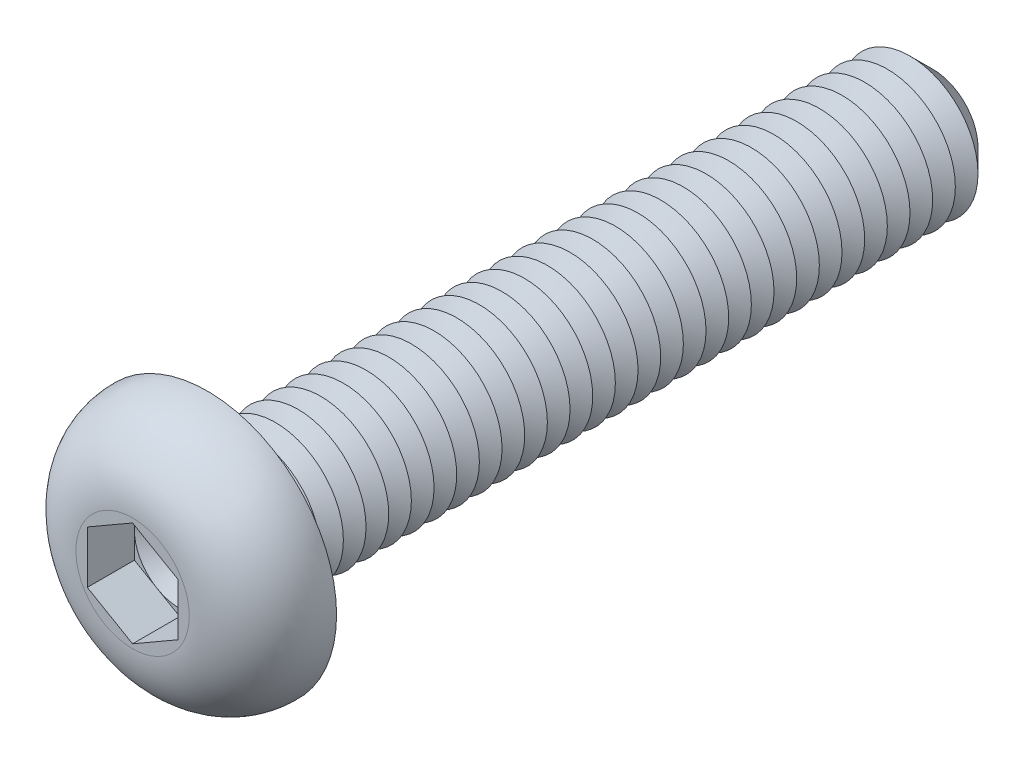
ISO-10303-21;
HEADER;
FILE_DESCRIPTION(('STEP AP214'),'2;1');
FILE_NAME('part.step','',(''),(''),'','','');
FILE_SCHEMA(('AUTOMOTIVE_DESIGN { 1 0 10303 214 1 1 1 1 }'));
ENDSEC;
DATA;
#1=APPLICATION_CONTEXT('core data for automotive mechanical design processes');
#2=APPLICATION_PROTOCOL_DEFINITION('international standard','automotive_design',2000,#1);
#3=PRODUCT_CONTEXT('',#1,'mechanical');
#4=PRODUCT('Part','Part','',(#3));
#5=PRODUCT_RELATED_PRODUCT_CATEGORY('part','',(#4));
#6=PRODUCT_DEFINITION_FORMATION('','',#4);
#7=PRODUCT_DEFINITION_CONTEXT('part definition',#1,'design');
#8=PRODUCT_DEFINITION('design','',#6,#7);
#9=PRODUCT_DEFINITION_SHAPE('','',#8);
#10=(LENGTH_UNIT() NAMED_UNIT(*) SI_UNIT(.MILLI.,.METRE.));
#11=(NAMED_UNIT(*) PLANE_ANGLE_UNIT() SI_UNIT($,.RADIAN.));
#12=(NAMED_UNIT(*) SI_UNIT($,.STERADIAN.) SOLID_ANGLE_UNIT());
#13=UNCERTAINTY_MEASURE_WITH_UNIT(LENGTH_MEASURE(1.E-05),#10,'distance_accuracy_value','');
#14=(GEOMETRIC_REPRESENTATION_CONTEXT(3) GLOBAL_UNCERTAINTY_ASSIGNED_CONTEXT((#13)) GLOBAL_UNIT_ASSIGNED_CONTEXT((#10,
#11,#12)) REPRESENTATION_CONTEXT('',''));
#15=CARTESIAN_POINT('',(0.,0.,0.));
#16=DIRECTION('',(0.,0.,1.));
#17=DIRECTION('',(1.,0.,0.));
#18=AXIS2_PLACEMENT_3D('',#15,#16,#17);
#19=CARTESIAN_POINT('',(0.,0.,0.61));
#20=DIRECTION('',(0.,0.,1.));
#21=DIRECTION('',(1.,0.,0.));
#22=AXIS2_PLACEMENT_3D('',#19,#20,#21);
#23=PLANE('',#22);
#24=CARTESIAN_POINT('',(0.,0.,0.61));
#25=DIRECTION('',(0.,0.,1.));
#26=DIRECTION('',(1.,0.,0.));
#27=AXIS2_PLACEMENT_3D('',#24,#25,#26);
#28=CIRCLE('',#27,1.);
#29=CARTESIAN_POINT('',(1.,0.,0.61));
#30=VERTEX_POINT('',#29);
#31=CARTESIAN_POINT('',(0.5,0.866025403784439,0.61));
#32=VERTEX_POINT('',#31);
#33=EDGE_CURVE('E117',#30,#32,#28,.T.);
#34=ORIENTED_EDGE('',*,*,#33,.F.);
#35=DIRECTION('',(0.,1.,0.));
#36=VECTOR('',#35,1.);
#37=CARTESIAN_POINT('',(1.,-0.577350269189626,0.61));
#38=LINE('',#37,#36);
#39=CARTESIAN_POINT('',(1.,0.577350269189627,0.61));
#40=VERTEX_POINT('',#39);
#41=EDGE_CURVE('E140',#30,#40,#38,.T.);
#42=ORIENTED_EDGE('',*,*,#41,.T.);
#43=DIRECTION('',(-0.866025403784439,0.5,0.));
#44=VECTOR('',#43,1.);
#45=CARTESIAN_POINT('',(1.,0.577350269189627,0.61));
#46=LINE('',#45,#44);
#47=EDGE_CURVE('E135',#40,#32,#46,.T.);
#48=ORIENTED_EDGE('',*,*,#47,.T.);
#49=EDGE_LOOP('',(#34,#42,#48));
#50=FACE_BOUND('',#49,.T.);
#51=ADVANCED_FACE('F39',(#50),#23,.T.);
#52=CARTESIAN_POINT('',(0.,0.,0.61));
#53=DIRECTION('',(0.,0.,1.));
#54=DIRECTION('',(1.,0.,0.));
#55=AXIS2_PLACEMENT_3D('',#52,#53,#54);
#56=CIRCLE('',#55,1.);
#57=CARTESIAN_POINT('',(-0.5,0.866025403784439,0.61));
#58=VERTEX_POINT('',#57);
#59=EDGE_CURVE('E11',#32,#58,#56,.T.);
#60=ORIENTED_EDGE('',*,*,#59,.F.);
#61=CARTESIAN_POINT('',(0.,1.15470053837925,0.61));
#62=VERTEX_POINT('',#61);
#63=EDGE_CURVE('E130',#32,#62,#46,.T.);
#64=ORIENTED_EDGE('',*,*,#63,.T.);
#65=DIRECTION('',(-0.866025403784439,-0.5,0.));
#66=VECTOR('',#65,1.);
#67=CARTESIAN_POINT('',(0.,1.15470053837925,0.61));
#68=LINE('',#67,#66);
#69=EDGE_CURVE('E132',#62,#58,#68,.T.);
#70=ORIENTED_EDGE('',*,*,#69,.T.);
#71=EDGE_LOOP('',(#60,#64,#70));
#72=FACE_BOUND('',#71,.T.);
#73=ADVANCED_FACE('F129',(#72),#23,.T.);
#74=CARTESIAN_POINT('',(-1.,0.,0.61));
#75=VERTEX_POINT('',#74);
#76=EDGE_CURVE('E49',#58,#75,#56,.T.);
#77=ORIENTED_EDGE('',*,*,#76,.F.);
#78=CARTESIAN_POINT('',(-1.,0.577350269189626,0.61));
#79=VERTEX_POINT('',#78);
#80=EDGE_CURVE('E143',#58,#79,#68,.T.);
#81=ORIENTED_EDGE('',*,*,#80,.T.);
#82=DIRECTION('',(0.,-1.,0.));
#83=VECTOR('',#82,1.);
#84=CARTESIAN_POINT('',(-1.,0.577350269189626,0.61));
#85=LINE('',#84,#83);
#86=EDGE_CURVE('E154',#79,#75,#85,.T.);
#87=ORIENTED_EDGE('',*,*,#86,.T.);
#88=EDGE_LOOP('',(#77,#81,#87));
#89=FACE_BOUND('',#88,.T.);
#90=ADVANCED_FACE('F251',(#89),#23,.T.);
#91=CARTESIAN_POINT('',(-0.5,-0.866025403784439,0.61));
#92=VERTEX_POINT('',#91);
#93=EDGE_CURVE('E233',#75,#92,#56,.T.);
#94=ORIENTED_EDGE('',*,*,#93,.F.);
#95=CARTESIAN_POINT('',(-1.,-0.577350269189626,0.61));
#96=VERTEX_POINT('',#95);
#97=EDGE_CURVE('E153',#75,#96,#85,.T.);
#98=ORIENTED_EDGE('',*,*,#97,.T.);
#99=DIRECTION('',(0.866025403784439,-0.5,0.));
#100=VECTOR('',#99,1.);
#101=CARTESIAN_POINT('',(-1.,-0.577350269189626,0.61));
#102=LINE('',#101,#100);
#103=EDGE_CURVE('E159',#96,#92,#102,.T.);
#104=ORIENTED_EDGE('',*,*,#103,.T.);
#105=EDGE_LOOP('',(#94,#98,#104));
#106=FACE_BOUND('',#105,.T.);
#107=ADVANCED_FACE('F244',(#106),#23,.T.);
#108=CARTESIAN_POINT('',(0.5,-0.866025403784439,0.61));
#109=VERTEX_POINT('',#108);
#110=EDGE_CURVE('E56',#92,#109,#56,.T.);
#111=ORIENTED_EDGE('',*,*,#110,.F.);
#112=CARTESIAN_POINT('',(0.,-1.15470053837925,0.61));
#113=VERTEX_POINT('',#112);
#114=EDGE_CURVE('E158',#92,#113,#102,.T.);
#115=ORIENTED_EDGE('',*,*,#114,.T.);
#116=DIRECTION('',(0.866025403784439,0.5,0.));
#117=VECTOR('',#116,1.);
#118=CARTESIAN_POINT('',(0.,-1.15470053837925,0.61));
#119=LINE('',#118,#117);
#120=EDGE_CURVE('E164',#113,#109,#119,.T.);
#121=ORIENTED_EDGE('',*,*,#120,.T.);
#122=EDGE_LOOP('',(#111,#115,#121));
#123=FACE_BOUND('',#122,.T.);
#124=ADVANCED_FACE('F381',(#123),#23,.T.);
#125=CARTESIAN_POINT('',(0.,0.,-16.));
#126=DIRECTION('',(0.,0.,1.));
#127=DIRECTION('',(1.,0.,0.));
#128=AXIS2_PLACEMENT_3D('',#125,#126,#127);
#129=CYLINDRICAL_SURFACE('',#128,1.5);
#130=CARTESIAN_POINT('',(0.,0.,-0.199999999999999));
#131=DIRECTION('',(0.,0.,1.));
#132=DIRECTION('',(1.,0.,0.));
#133=AXIS2_PLACEMENT_3D('',#130,#131,#132);
#134=CIRCLE('',#133,1.5);
#135=CARTESIAN_POINT('',(1.5,0.,-0.199999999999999));
#136=VERTEX_POINT('',#135);
#137=EDGE_CURVE('E222',#136,#136,#134,.F.);
#138=ORIENTED_EDGE('',*,*,#137,.T.);
#139=EDGE_LOOP('',(#138));
#140=FACE_BOUND('',#139,.T.);
#141=CARTESIAN_POINT('',(0.,0.,-0.5));
#142=DIRECTION('',(0.,0.,1.));
#143=DIRECTION('',(1.,0.,0.));
#144=AXIS2_PLACEMENT_3D('',#141,#142,#143);
#145=CIRCLE('',#144,1.50000000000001);
#146=CARTESIAN_POINT('',(1.50000000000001,0.,-0.5));
#147=VERTEX_POINT('',#146);
#148=EDGE_CURVE('E149',#147,#147,#145,.T.);
#149=ORIENTED_EDGE('',*,*,#148,.T.);
#150=EDGE_LOOP('',(#149));
#151=FACE_BOUND('',#150,.T.);
#152=ADVANCED_FACE('F365',(#140,#151),#129,.T.);
#153=CARTESIAN_POINT('',(0.,2.85,0.));
#154=DIRECTION('',(0.,0.,1.));
#155=DIRECTION('',(1.,0.,0.));
#156=AXIS2_PLACEMENT_3D('',#153,#154,#155);
#157=PLANE('',#156);
#158=CARTESIAN_POINT('',(0.,0.,0.));
#159=DIRECTION('',(0.,0.,1.));
#160=DIRECTION('',(1.,0.,0.));
#161=AXIS2_PLACEMENT_3D('',#158,#159,#160);
#162=CIRCLE('',#161,1.7);
#163=CARTESIAN_POINT('',(1.7,0.,0.));
#164=VERTEX_POINT('',#163);
#165=EDGE_CURVE('E224',#164,#164,#162,.T.);
#166=ORIENTED_EDGE('',*,*,#165,.T.);
#167=EDGE_LOOP('',(#166));
#168=FACE_BOUND('',#167,.T.);
#169=CARTESIAN_POINT('',(0.,0.,0.));
#170=DIRECTION('',(0.,0.,1.));
#171=DIRECTION('',(1.,0.,0.));
#172=AXIS2_PLACEMENT_3D('',#169,#170,#171);
#173=CIRCLE('',#172,2.85);
#174=CARTESIAN_POINT('',(2.85,0.,0.));
#175=VERTEX_POINT('',#174);
#176=EDGE_CURVE('E196',#175,#175,#173,.T.);
#177=ORIENTED_EDGE('',*,*,#176,.F.);
#178=EDGE_LOOP('',(#177));
#179=FACE_BOUND('',#178,.T.);
#180=ADVANCED_FACE('F411',(#168,#179),#157,.F.);
#181=CARTESIAN_POINT('',(0.,0.,1.65));
#182=DIRECTION('',(0.,0.,-1.));
#183=DIRECTION('',(-1.,0.,0.));
#184=AXIS2_PLACEMENT_3D('',#181,#182,#183);
#185=PLANE('',#184);
#186=DIRECTION('',(-0.866025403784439,-0.5,0.));
#187=VECTOR('',#186,1.);
#188=CARTESIAN_POINT('',(0.,1.15470053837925,1.65));
#189=LINE('',#188,#187);
#190=CARTESIAN_POINT('',(0.,1.15470053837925,1.65));
#191=VERTEX_POINT('',#190);
#192=CARTESIAN_POINT('',(-1.,0.577350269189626,1.65));
#193=VERTEX_POINT('',#192);
#194=EDGE_CURVE('E174',#191,#193,#189,.T.);
#195=ORIENTED_EDGE('',*,*,#194,.F.);
#196=DIRECTION('',(-0.866025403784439,0.5,0.));
#197=VECTOR('',#196,1.);
#198=CARTESIAN_POINT('',(1.,0.577350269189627,1.65));
#199=LINE('',#198,#197);
#200=CARTESIAN_POINT('',(1.,0.577350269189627,1.65));
#201=VERTEX_POINT('',#200);
#202=EDGE_CURVE('E64',#201,#191,#199,.T.);
#203=ORIENTED_EDGE('',*,*,#202,.F.);
#204=DIRECTION('',(0.,1.,0.));
#205=VECTOR('',#204,1.);
#206=CARTESIAN_POINT('',(1.,-0.577350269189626,1.65));
#207=LINE('',#206,#205);
#208=CARTESIAN_POINT('',(1.,-0.577350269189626,1.65));
#209=VERTEX_POINT('',#208);
#210=EDGE_CURVE('E138',#209,#201,#207,.T.);
#211=ORIENTED_EDGE('',*,*,#210,.F.);
#212=DIRECTION('',(0.866025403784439,0.5,0.));
#213=VECTOR('',#212,1.);
#214=CARTESIAN_POINT('',(0.,-1.15470053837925,1.65));
#215=LINE('',#214,#213);
#216=CARTESIAN_POINT('',(0.,-1.15470053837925,1.65));
#217=VERTEX_POINT('',#216);
#218=EDGE_CURVE('E186',#217,#209,#215,.T.);
#219=ORIENTED_EDGE('',*,*,#218,.F.);
#220=DIRECTION('',(0.866025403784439,-0.5,0.));
#221=VECTOR('',#220,1.);
#222=CARTESIAN_POINT('',(-1.,-0.577350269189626,1.65));
#223=LINE('',#222,#221);
#224=CARTESIAN_POINT('',(-1.,-0.577350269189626,1.65));
#225=VERTEX_POINT('',#224);
#226=EDGE_CURVE('E182',#225,#217,#223,.T.);
#227=ORIENTED_EDGE('',*,*,#226,.F.);
#228=DIRECTION('',(0.,-1.,0.));
#229=VECTOR('',#228,1.);
#230=CARTESIAN_POINT('',(-1.,0.577350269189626,1.65));
#231=LINE('',#230,#229);
#232=EDGE_CURVE('E178',#193,#225,#231,.T.);
#233=ORIENTED_EDGE('',*,*,#232,.F.);
#234=EDGE_LOOP('',(#195,#203,#211,#219,#227,#233));
#235=FACE_BOUND('',#234,.T.);
#236=CARTESIAN_POINT('',(0.,0.,1.65));
#237=DIRECTION('',(0.,0.,1.));
#238=DIRECTION('',(1.,0.,0.));
#239=AXIS2_PLACEMENT_3D('',#236,#237,#238);
#240=CIRCLE('',#239,1.25078144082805);
#241=CARTESIAN_POINT('',(1.25078144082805,0.,1.65));
#242=VERTEX_POINT('',#241);
#243=EDGE_CURVE('E214',#242,#242,#240,.T.);
#244=ORIENTED_EDGE('',*,*,#243,.T.);
#245=EDGE_LOOP('',(#244));
#246=FACE_BOUND('',#245,.T.);
#247=ADVANCED_FACE('F260',(#235,#246),#185,.F.);
#248=CARTESIAN_POINT('',(0.,0.,0.0499999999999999));
#249=DIRECTION('',(0.,0.,1.));
#250=DIRECTION('',(1.,0.,0.));
#251=AXIS2_PLACEMENT_3D('',#248,#249,#250);
#252=DEGENERATE_TOROIDAL_SURFACE('',#251,1.25078144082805,1.6,.T.);
#253=ORIENTED_EDGE('',*,*,#243,.F.);
#254=EDGE_LOOP('',(#253));
#255=FACE_BOUND('',#254,.T.);
#256=ORIENTED_EDGE('',*,*,#176,.T.);
#257=EDGE_LOOP('',(#256));
#258=FACE_BOUND('',#257,.T.);
#259=ADVANCED_FACE('F405',(#255,#258),#252,.T.);
#260=CARTESIAN_POINT('',(1.,0.577350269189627,0.61));
#261=DIRECTION('',(0.5,0.866025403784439,0.));
#262=DIRECTION('',(-0.866025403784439,0.5,0.));
#263=AXIS2_PLACEMENT_3D('',#260,#261,#262);
#264=PLANE('',#263);
#265=ORIENTED_EDGE('',*,*,#202,.T.);
#266=DIRECTION('',(0.,0.,1.));
#267=VECTOR('',#266,1.);
#268=CARTESIAN_POINT('',(0.,1.15470053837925,0.61));
#269=LINE('',#268,#267);
#270=EDGE_CURVE('E136',#62,#191,#269,.T.);
#271=ORIENTED_EDGE('',*,*,#270,.F.);
#272=ORIENTED_EDGE('',*,*,#63,.F.);
#273=ORIENTED_EDGE('',*,*,#47,.F.);
#274=DIRECTION('',(0.,0.,1.));
#275=VECTOR('',#274,1.);
#276=CARTESIAN_POINT('',(1.,0.577350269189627,0.61));
#277=LINE('',#276,#275);
#278=EDGE_CURVE('E193',#40,#201,#277,.T.);
#279=ORIENTED_EDGE('',*,*,#278,.T.);
#280=EDGE_LOOP('',(#265,#271,#272,#273,#279));
#281=FACE_BOUND('',#280,.T.);
#282=ADVANCED_FACE('F134',(#281),#264,.F.);
#283=CARTESIAN_POINT('',(1.,-0.577350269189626,0.61));
#284=DIRECTION('',(1.,0.,0.));
#285=DIRECTION('',(0.,0.,-1.));
#286=AXIS2_PLACEMENT_3D('',#283,#284,#285);
#287=PLANE('',#286);
#288=ORIENTED_EDGE('',*,*,#210,.T.);
#289=ORIENTED_EDGE('',*,*,#278,.F.);
#290=ORIENTED_EDGE('',*,*,#41,.F.);
#291=CARTESIAN_POINT('',(1.,-0.577350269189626,0.61));
#292=VERTEX_POINT('',#291);
#293=EDGE_CURVE('E168',#292,#30,#38,.T.);
#294=ORIENTED_EDGE('',*,*,#293,.F.);
#295=DIRECTION('',(0.,0.,1.));
#296=VECTOR('',#295,1.);
#297=CARTESIAN_POINT('',(1.,-0.577350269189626,0.61));
#298=LINE('',#297,#296);
#299=EDGE_CURVE('E197',#292,#209,#298,.T.);
#300=ORIENTED_EDGE('',*,*,#299,.T.);
#301=EDGE_LOOP('',(#288,#289,#290,#294,#300));
#302=FACE_BOUND('',#301,.T.);
#303=ADVANCED_FACE('F389',(#302),#287,.F.);
#304=CARTESIAN_POINT('',(0.,-1.15470053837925,0.61));
#305=DIRECTION('',(0.5,-0.866025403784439,0.));
#306=DIRECTION('',(0.866025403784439,0.5,0.));
#307=AXIS2_PLACEMENT_3D('',#304,#305,#306);
#308=PLANE('',#307);
#309=ORIENTED_EDGE('',*,*,#218,.T.);
#310=ORIENTED_EDGE('',*,*,#299,.F.);
#311=EDGE_CURVE('E163',#109,#292,#119,.T.);
#312=ORIENTED_EDGE('',*,*,#311,.F.);
#313=ORIENTED_EDGE('',*,*,#120,.F.);
#314=DIRECTION('',(0.,0.,1.));
#315=VECTOR('',#314,1.);
#316=CARTESIAN_POINT('',(0.,-1.15470053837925,0.61));
#317=LINE('',#316,#315);
#318=EDGE_CURVE('E200',#113,#217,#317,.T.);
#319=ORIENTED_EDGE('',*,*,#318,.T.);
#320=EDGE_LOOP('',(#309,#310,#312,#313,#319));
#321=FACE_BOUND('',#320,.T.);
#322=ADVANCED_FACE('F392',(#321),#308,.F.);
#323=CARTESIAN_POINT('',(-1.,-0.577350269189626,0.61));
#324=DIRECTION('',(-0.5,-0.866025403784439,0.));
#325=DIRECTION('',(0.866025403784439,-0.5,0.));
#326=AXIS2_PLACEMENT_3D('',#323,#324,#325);
#327=PLANE('',#326);
#328=ORIENTED_EDGE('',*,*,#226,.T.);
#329=ORIENTED_EDGE('',*,*,#318,.F.);
#330=ORIENTED_EDGE('',*,*,#114,.F.);
#331=ORIENTED_EDGE('',*,*,#103,.F.);
#332=DIRECTION('',(0.,0.,1.));
#333=VECTOR('',#332,1.);
#334=CARTESIAN_POINT('',(-1.,-0.577350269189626,0.61));
#335=LINE('',#334,#333);
#336=EDGE_CURVE('E203',#96,#225,#335,.T.);
#337=ORIENTED_EDGE('',*,*,#336,.T.);
#338=EDGE_LOOP('',(#328,#329,#330,#331,#337));
#339=FACE_BOUND('',#338,.T.);
#340=ADVANCED_FACE('F265',(#339),#327,.F.);
#341=CARTESIAN_POINT('',(-1.,0.577350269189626,0.61));
#342=DIRECTION('',(-1.,0.,0.));
#343=DIRECTION('',(0.,-1.,0.));
#344=AXIS2_PLACEMENT_3D('',#341,#342,#343);
#345=PLANE('',#344);
#346=ORIENTED_EDGE('',*,*,#232,.T.);
#347=ORIENTED_EDGE('',*,*,#336,.F.);
#348=ORIENTED_EDGE('',*,*,#97,.F.);
#349=ORIENTED_EDGE('',*,*,#86,.F.);
#350=DIRECTION('',(0.,0.,1.));
#351=VECTOR('',#350,1.);
#352=CARTESIAN_POINT('',(-1.,0.577350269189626,0.61));
#353=LINE('',#352,#351);
#354=EDGE_CURVE('E206',#79,#193,#353,.T.);
#355=ORIENTED_EDGE('',*,*,#354,.T.);
#356=EDGE_LOOP('',(#346,#347,#348,#349,#355));
#357=FACE_BOUND('',#356,.T.);
#358=ADVANCED_FACE('F249',(#357),#345,.F.);
#359=CARTESIAN_POINT('',(0.,1.15470053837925,0.61));
#360=DIRECTION('',(-0.5,0.866025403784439,0.));
#361=DIRECTION('',(-0.866025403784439,-0.5,0.));
#362=AXIS2_PLACEMENT_3D('',#359,#360,#361);
#363=PLANE('',#362);
#364=ORIENTED_EDGE('',*,*,#194,.T.);
#365=ORIENTED_EDGE('',*,*,#354,.F.);
#366=ORIENTED_EDGE('',*,*,#80,.F.);
#367=ORIENTED_EDGE('',*,*,#69,.F.);
#368=ORIENTED_EDGE('',*,*,#270,.T.);
#369=EDGE_LOOP('',(#364,#365,#366,#367,#368));
#370=FACE_BOUND('',#369,.T.);
#371=ADVANCED_FACE('F254',(#370),#363,.F.);
#372=EDGE_CURVE('E43',#109,#30,#56,.T.);
#373=ORIENTED_EDGE('',*,*,#372,.F.);
#374=ORIENTED_EDGE('',*,*,#311,.T.);
#375=ORIENTED_EDGE('',*,*,#293,.T.);
#376=EDGE_LOOP('',(#373,#374,#375));
#377=FACE_BOUND('',#376,.T.);
#378=ADVANCED_FACE('F370',(#377),#23,.T.);
#379=CARTESIAN_POINT('',(0.,0.,-0.5));
#380=DIRECTION('',(0.,0.,1.));
#381=DIRECTION('',(1.,0.,0.));
#382=AXIS2_PLACEMENT_3D('',#379,#380,#381);
#383=CONICAL_SURFACE('',#382,1.50000000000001,1.0471975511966);
#384=CARTESIAN_POINT('',(0.,0.,-0.750000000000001));
#385=DIRECTION('',(0.,0.,1.));
#386=DIRECTION('',(1.,0.,0.));
#387=AXIS2_PLACEMENT_3D('',#384,#385,#386);
#388=CIRCLE('',#387,1.06698729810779);
#389=CARTESIAN_POINT('',(1.06698729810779,0.,-0.750000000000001));
#390=VERTEX_POINT('',#389);
#391=EDGE_CURVE('E355',#390,#390,#388,.T.);
#392=ORIENTED_EDGE('',*,*,#391,.T.);
#393=EDGE_LOOP('',(#392));
#394=FACE_BOUND('',#393,.T.);
#395=ORIENTED_EDGE('',*,*,#148,.F.);
#396=EDGE_LOOP('',(#395));
#397=FACE_BOUND('',#396,.T.);
#398=ADVANCED_FACE('F367',(#394,#397),#383,.T.);
#399=CARTESIAN_POINT('',(0.,0.,-0.750000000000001));
#400=DIRECTION('',(0.,0.,-1.));
#401=DIRECTION('',(-1.,0.,0.));
#402=AXIS2_PLACEMENT_3D('',#399,#400,#401);
#403=CONICAL_SURFACE('',#402,1.06698729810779,1.0471975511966);
#404=CARTESIAN_POINT('',(0.,0.,-1.));
#405=DIRECTION('',(0.,0.,1.));
#406=DIRECTION('',(1.,0.,0.));
#407=AXIS2_PLACEMENT_3D('',#404,#405,#406);
#408=CIRCLE('',#407,1.50000000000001);
#409=CARTESIAN_POINT('',(1.50000000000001,0.,-1.));
#410=VERTEX_POINT('',#409);
#411=EDGE_CURVE('E352',#410,#410,#408,.T.);
#412=ORIENTED_EDGE('',*,*,#411,.T.);
#413=EDGE_LOOP('',(#412));
#414=FACE_BOUND('',#413,.T.);
#415=ORIENTED_EDGE('',*,*,#391,.F.);
#416=EDGE_LOOP('',(#415));
#417=FACE_BOUND('',#416,.T.);
#418=ADVANCED_FACE('F369',(#414,#417),#403,.T.);
#419=CARTESIAN_POINT('',(0.,0.,-1.));
#420=DIRECTION('',(0.,0.,1.));
#421=DIRECTION('',(1.,0.,0.));
#422=AXIS2_PLACEMENT_3D('',#419,#420,#421);
#423=CONICAL_SURFACE('',#422,1.50000000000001,1.0471975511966);
#424=CARTESIAN_POINT('',(0.,0.,-1.25));
#425=DIRECTION('',(0.,0.,1.));
#426=DIRECTION('',(1.,0.,0.));
#427=AXIS2_PLACEMENT_3D('',#424,#425,#426);
#428=CIRCLE('',#427,1.06698729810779);
#429=CARTESIAN_POINT('',(1.06698729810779,0.,-1.25));
#430=VERTEX_POINT('',#429);
#431=EDGE_CURVE('E348',#430,#430,#428,.T.);
#432=ORIENTED_EDGE('',*,*,#431,.T.);
#433=EDGE_LOOP('',(#432));
#434=FACE_BOUND('',#433,.T.);
#435=ORIENTED_EDGE('',*,*,#411,.F.);
#436=EDGE_LOOP('',(#435));
#437=FACE_BOUND('',#436,.T.);
#438=ADVANCED_FACE('F376',(#434,#437),#423,.T.);
#439=CARTESIAN_POINT('',(0.,0.,-1.25));
#440=DIRECTION('',(0.,0.,-1.));
#441=DIRECTION('',(-1.,0.,0.));
#442=AXIS2_PLACEMENT_3D('',#439,#440,#441);
#443=CONICAL_SURFACE('',#442,1.06698729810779,1.0471975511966);
#444=CARTESIAN_POINT('',(0.,0.,-1.5));
#445=DIRECTION('',(0.,0.,1.));
#446=DIRECTION('',(1.,0.,0.));
#447=AXIS2_PLACEMENT_3D('',#444,#445,#446);
#448=CIRCLE('',#447,1.50000000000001);
#449=CARTESIAN_POINT('',(1.50000000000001,0.,-1.5));
#450=VERTEX_POINT('',#449);
#451=EDGE_CURVE('E344',#450,#450,#448,.T.);
#452=ORIENTED_EDGE('',*,*,#451,.T.);
#453=EDGE_LOOP('',(#452));
#454=FACE_BOUND('',#453,.T.);
#455=ORIENTED_EDGE('',*,*,#431,.F.);
#456=EDGE_LOOP('',(#455));
#457=FACE_BOUND('',#456,.T.);
#458=ADVANCED_FACE('F648',(#454,#457),#443,.T.);
#459=CARTESIAN_POINT('',(0.,0.,-1.5));
#460=DIRECTION('',(0.,0.,1.));
#461=DIRECTION('',(1.,0.,0.));
#462=AXIS2_PLACEMENT_3D('',#459,#460,#461);
#463=CONICAL_SURFACE('',#462,1.50000000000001,1.0471975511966);
#464=CARTESIAN_POINT('',(0.,0.,-1.75));
#465=DIRECTION('',(0.,0.,1.));
#466=DIRECTION('',(1.,0.,0.));
#467=AXIS2_PLACEMENT_3D('',#464,#465,#466);
#468=CIRCLE('',#467,1.06698729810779);
#469=CARTESIAN_POINT('',(1.06698729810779,0.,-1.75));
#470=VERTEX_POINT('',#469);
#471=EDGE_CURVE('E340',#470,#470,#468,.T.);
#472=ORIENTED_EDGE('',*,*,#471,.T.);
#473=EDGE_LOOP('',(#472));
#474=FACE_BOUND('',#473,.T.);
#475=ORIENTED_EDGE('',*,*,#451,.F.);
#476=EDGE_LOOP('',(#475));
#477=FACE_BOUND('',#476,.T.);
#478=ADVANCED_FACE('F644',(#474,#477),#463,.T.);
#479=CARTESIAN_POINT('',(0.,0.,-1.75));
#480=DIRECTION('',(0.,0.,-1.));
#481=DIRECTION('',(-1.,0.,0.));
#482=AXIS2_PLACEMENT_3D('',#479,#480,#481);
#483=CONICAL_SURFACE('',#482,1.06698729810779,1.0471975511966);
#484=CARTESIAN_POINT('',(0.,0.,-2.));
#485=DIRECTION('',(0.,0.,1.));
#486=DIRECTION('',(1.,0.,0.));
#487=AXIS2_PLACEMENT_3D('',#484,#485,#486);
#488=CIRCLE('',#487,1.50000000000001);
#489=CARTESIAN_POINT('',(1.50000000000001,0.,-2.));
#490=VERTEX_POINT('',#489);
#491=EDGE_CURVE('E336',#490,#490,#488,.T.);
#492=ORIENTED_EDGE('',*,*,#491,.T.);
#493=EDGE_LOOP('',(#492));
#494=FACE_BOUND('',#493,.T.);
#495=ORIENTED_EDGE('',*,*,#471,.F.);
#496=EDGE_LOOP('',(#495));
#497=FACE_BOUND('',#496,.T.);
#498=ADVANCED_FACE('F640',(#494,#497),#483,.T.);
#499=CARTESIAN_POINT('',(0.,0.,-2.));
#500=DIRECTION('',(0.,0.,1.));
#501=DIRECTION('',(1.,0.,0.));
#502=AXIS2_PLACEMENT_3D('',#499,#500,#501);
#503=CONICAL_SURFACE('',#502,1.50000000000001,1.0471975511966);
#504=CARTESIAN_POINT('',(0.,0.,-2.25));
#505=DIRECTION('',(0.,0.,1.));
#506=DIRECTION('',(1.,0.,0.));
#507=AXIS2_PLACEMENT_3D('',#504,#505,#506);
#508=CIRCLE('',#507,1.06698729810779);
#509=CARTESIAN_POINT('',(1.06698729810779,0.,-2.25));
#510=VERTEX_POINT('',#509);
#511=EDGE_CURVE('E333',#510,#510,#508,.T.);
#512=ORIENTED_EDGE('',*,*,#511,.T.);
#513=EDGE_LOOP('',(#512));
#514=FACE_BOUND('',#513,.T.);
#515=ORIENTED_EDGE('',*,*,#491,.F.);
#516=EDGE_LOOP('',(#515));
#517=FACE_BOUND('',#516,.T.);
#518=ADVANCED_FACE('F636',(#514,#517),#503,.T.);
#519=CARTESIAN_POINT('',(0.,0.,-2.25));
#520=DIRECTION('',(0.,0.,-1.));
#521=DIRECTION('',(-1.,0.,0.));
#522=AXIS2_PLACEMENT_3D('',#519,#520,#521);
#523=CONICAL_SURFACE('',#522,1.06698729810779,1.0471975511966);
#524=CARTESIAN_POINT('',(0.,0.,-2.5));
#525=DIRECTION('',(0.,0.,1.));
#526=DIRECTION('',(1.,0.,0.));
#527=AXIS2_PLACEMENT_3D('',#524,#525,#526);
#528=CIRCLE('',#527,1.50000000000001);
#529=CARTESIAN_POINT('',(1.50000000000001,0.,-2.5));
#530=VERTEX_POINT('',#529);
#531=EDGE_CURVE('E329',#530,#530,#528,.T.);
#532=ORIENTED_EDGE('',*,*,#531,.T.);
#533=EDGE_LOOP('',(#532));
#534=FACE_BOUND('',#533,.T.);
#535=ORIENTED_EDGE('',*,*,#511,.F.);
#536=EDGE_LOOP('',(#535));
#537=FACE_BOUND('',#536,.T.);
#538=ADVANCED_FACE('F632',(#534,#537),#523,.T.);
#539=CARTESIAN_POINT('',(0.,0.,-2.5));
#540=DIRECTION('',(0.,0.,1.));
#541=DIRECTION('',(1.,0.,0.));
#542=AXIS2_PLACEMENT_3D('',#539,#540,#541);
#543=CONICAL_SURFACE('',#542,1.50000000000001,1.0471975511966);
#544=CARTESIAN_POINT('',(0.,0.,-2.75));
#545=DIRECTION('',(0.,0.,1.));
#546=DIRECTION('',(1.,0.,0.));
#547=AXIS2_PLACEMENT_3D('',#544,#545,#546);
#548=CIRCLE('',#547,1.06698729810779);
#549=CARTESIAN_POINT('',(1.06698729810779,0.,-2.75));
#550=VERTEX_POINT('',#549);
#551=EDGE_CURVE('E325',#550,#550,#548,.T.);
#552=ORIENTED_EDGE('',*,*,#551,.T.);
#553=EDGE_LOOP('',(#552));
#554=FACE_BOUND('',#553,.T.);
#555=ORIENTED_EDGE('',*,*,#531,.F.);
#556=EDGE_LOOP('',(#555));
#557=FACE_BOUND('',#556,.T.);
#558=ADVANCED_FACE('F628',(#554,#557),#543,.T.);
#559=CARTESIAN_POINT('',(0.,0.,-2.75));
#560=DIRECTION('',(0.,0.,-1.));
#561=DIRECTION('',(-1.,0.,0.));
#562=AXIS2_PLACEMENT_3D('',#559,#560,#561);
#563=CONICAL_SURFACE('',#562,1.06698729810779,1.0471975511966);
#564=CARTESIAN_POINT('',(0.,0.,-3.));
#565=DIRECTION('',(0.,0.,1.));
#566=DIRECTION('',(1.,0.,0.));
#567=AXIS2_PLACEMENT_3D('',#564,#565,#566);
#568=CIRCLE('',#567,1.50000000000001);
#569=CARTESIAN_POINT('',(1.50000000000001,0.,-3.));
#570=VERTEX_POINT('',#569);
#571=EDGE_CURVE('E321',#570,#570,#568,.T.);
#572=ORIENTED_EDGE('',*,*,#571,.T.);
#573=EDGE_LOOP('',(#572));
#574=FACE_BOUND('',#573,.T.);
#575=ORIENTED_EDGE('',*,*,#551,.F.);
#576=EDGE_LOOP('',(#575));
#577=FACE_BOUND('',#576,.T.);
#578=ADVANCED_FACE('F624',(#574,#577),#563,.T.);
#579=CARTESIAN_POINT('',(0.,0.,-3.));
#580=DIRECTION('',(0.,0.,1.));
#581=DIRECTION('',(1.,0.,0.));
#582=AXIS2_PLACEMENT_3D('',#579,#580,#581);
#583=CONICAL_SURFACE('',#582,1.50000000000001,1.0471975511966);
#584=CARTESIAN_POINT('',(0.,0.,-3.25));
#585=DIRECTION('',(0.,0.,1.));
#586=DIRECTION('',(1.,0.,0.));
#587=AXIS2_PLACEMENT_3D('',#584,#585,#586);
#588=CIRCLE('',#587,1.06698729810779);
#589=CARTESIAN_POINT('',(1.06698729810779,0.,-3.25));
#590=VERTEX_POINT('',#589);
#591=EDGE_CURVE('E317',#590,#590,#588,.T.);
#592=ORIENTED_EDGE('',*,*,#591,.T.);
#593=EDGE_LOOP('',(#592));
#594=FACE_BOUND('',#593,.T.);
#595=ORIENTED_EDGE('',*,*,#571,.F.);
#596=EDGE_LOOP('',(#595));
#597=FACE_BOUND('',#596,.T.);
#598=ADVANCED_FACE('F620',(#594,#597),#583,.T.);
#599=CARTESIAN_POINT('',(0.,0.,-3.25));
#600=DIRECTION('',(0.,0.,-1.));
#601=DIRECTION('',(-1.,0.,0.));
#602=AXIS2_PLACEMENT_3D('',#599,#600,#601);
#603=CONICAL_SURFACE('',#602,1.06698729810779,1.0471975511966);
#604=CARTESIAN_POINT('',(0.,0.,-3.5));
#605=DIRECTION('',(0.,0.,1.));
#606=DIRECTION('',(1.,0.,0.));
#607=AXIS2_PLACEMENT_3D('',#604,#605,#606);
#608=CIRCLE('',#607,1.50000000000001);
#609=CARTESIAN_POINT('',(1.50000000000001,0.,-3.5));
#610=VERTEX_POINT('',#609);
#611=EDGE_CURVE('E313',#610,#610,#608,.T.);
#612=ORIENTED_EDGE('',*,*,#611,.T.);
#613=EDGE_LOOP('',(#612));
#614=FACE_BOUND('',#613,.T.);
#615=ORIENTED_EDGE('',*,*,#591,.F.);
#616=EDGE_LOOP('',(#615));
#617=FACE_BOUND('',#616,.T.);
#618=ADVANCED_FACE('F616',(#614,#617),#603,.T.);
#619=CARTESIAN_POINT('',(0.,0.,-3.5));
#620=DIRECTION('',(0.,0.,1.));
#621=DIRECTION('',(1.,0.,0.));
#622=AXIS2_PLACEMENT_3D('',#619,#620,#621);
#623=CONICAL_SURFACE('',#622,1.50000000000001,1.0471975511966);
#624=CARTESIAN_POINT('',(0.,0.,-3.75));
#625=DIRECTION('',(0.,0.,1.));
#626=DIRECTION('',(1.,0.,0.));
#627=AXIS2_PLACEMENT_3D('',#624,#625,#626);
#628=CIRCLE('',#627,1.06698729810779);
#629=CARTESIAN_POINT('',(1.06698729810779,0.,-3.75));
#630=VERTEX_POINT('',#629);
#631=EDGE_CURVE('E309',#630,#630,#628,.T.);
#632=ORIENTED_EDGE('',*,*,#631,.T.);
#633=EDGE_LOOP('',(#632));
#634=FACE_BOUND('',#633,.T.);
#635=ORIENTED_EDGE('',*,*,#611,.F.);
#636=EDGE_LOOP('',(#635));
#637=FACE_BOUND('',#636,.T.);
#638=ADVANCED_FACE('F612',(#634,#637),#623,.T.);
#639=CARTESIAN_POINT('',(0.,0.,-3.75));
#640=DIRECTION('',(0.,0.,-1.));
#641=DIRECTION('',(-1.,0.,0.));
#642=AXIS2_PLACEMENT_3D('',#639,#640,#641);
#643=CONICAL_SURFACE('',#642,1.06698729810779,1.0471975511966);
#644=CARTESIAN_POINT('',(0.,0.,-4.));
#645=DIRECTION('',(0.,0.,1.));
#646=DIRECTION('',(1.,0.,0.));
#647=AXIS2_PLACEMENT_3D('',#644,#645,#646);
#648=CIRCLE('',#647,1.50000000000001);
#649=CARTESIAN_POINT('',(1.50000000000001,0.,-4.));
#650=VERTEX_POINT('',#649);
#651=EDGE_CURVE('E272',#650,#650,#648,.T.);
#652=ORIENTED_EDGE('',*,*,#651,.T.);
#653=EDGE_LOOP('',(#652));
#654=FACE_BOUND('',#653,.T.);
#655=ORIENTED_EDGE('',*,*,#631,.F.);
#656=EDGE_LOOP('',(#655));
#657=FACE_BOUND('',#656,.T.);
#658=ADVANCED_FACE('F608',(#654,#657),#643,.T.);
#659=CARTESIAN_POINT('',(0.,0.,-4.));
#660=DIRECTION('',(0.,0.,1.));
#661=DIRECTION('',(1.,0.,0.));
#662=AXIS2_PLACEMENT_3D('',#659,#660,#661);
#663=CONICAL_SURFACE('',#662,1.50000000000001,1.0471975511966);
#664=CARTESIAN_POINT('',(0.,0.,-4.25));
#665=DIRECTION('',(0.,0.,1.));
#666=DIRECTION('',(1.,0.,0.));
#667=AXIS2_PLACEMENT_3D('',#664,#665,#666);
#668=CIRCLE('',#667,1.06698729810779);
#669=CARTESIAN_POINT('',(1.06698729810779,0.,-4.25));
#670=VERTEX_POINT('',#669);
#671=EDGE_CURVE('E296',#670,#670,#668,.T.);
#672=ORIENTED_EDGE('',*,*,#671,.T.);
#673=EDGE_LOOP('',(#672));
#674=FACE_BOUND('',#673,.T.);
#675=ORIENTED_EDGE('',*,*,#651,.F.);
#676=EDGE_LOOP('',(#675));
#677=FACE_BOUND('',#676,.T.);
#678=ADVANCED_FACE('F604',(#674,#677),#663,.T.);
#679=CARTESIAN_POINT('',(0.,0.,-4.25));
#680=DIRECTION('',(0.,0.,-1.));
#681=DIRECTION('',(-1.,0.,0.));
#682=AXIS2_PLACEMENT_3D('',#679,#680,#681);
#683=CONICAL_SURFACE('',#682,1.06698729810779,1.0471975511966);
#684=CARTESIAN_POINT('',(0.,0.,-4.5));
#685=DIRECTION('',(0.,0.,1.));
#686=DIRECTION('',(1.,0.,0.));
#687=AXIS2_PLACEMENT_3D('',#684,#685,#686);
#688=CIRCLE('',#687,1.50000000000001);
#689=CARTESIAN_POINT('',(1.50000000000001,0.,-4.5));
#690=VERTEX_POINT('',#689);
#691=EDGE_CURVE('E289',#690,#690,#688,.T.);
#692=ORIENTED_EDGE('',*,*,#691,.T.);
#693=EDGE_LOOP('',(#692));
#694=FACE_BOUND('',#693,.T.);
#695=ORIENTED_EDGE('',*,*,#671,.F.);
#696=EDGE_LOOP('',(#695));
#697=FACE_BOUND('',#696,.T.);
#698=ADVANCED_FACE('F601',(#694,#697),#683,.T.);
#699=CARTESIAN_POINT('',(0.,0.,-4.5));
#700=DIRECTION('',(0.,0.,1.));
#701=DIRECTION('',(1.,0.,0.));
#702=AXIS2_PLACEMENT_3D('',#699,#700,#701);
#703=CONICAL_SURFACE('',#702,1.50000000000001,1.0471975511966);
#704=CARTESIAN_POINT('',(0.,0.,-4.75));
#705=DIRECTION('',(0.,0.,1.));
#706=DIRECTION('',(1.,0.,0.));
#707=AXIS2_PLACEMENT_3D('',#704,#705,#706);
#708=CIRCLE('',#707,1.06698729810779);
#709=CARTESIAN_POINT('',(1.06698729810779,0.,-4.75));
#710=VERTEX_POINT('',#709);
#711=EDGE_CURVE('E287',#710,#710,#708,.T.);
#712=ORIENTED_EDGE('',*,*,#711,.T.);
#713=EDGE_LOOP('',(#712));
#714=FACE_BOUND('',#713,.T.);
#715=ORIENTED_EDGE('',*,*,#691,.F.);
#716=EDGE_LOOP('',(#715));
#717=FACE_BOUND('',#716,.T.);
#718=ADVANCED_FACE('F597',(#714,#717),#703,.T.);
#719=CARTESIAN_POINT('',(0.,0.,-4.75));
#720=DIRECTION('',(0.,0.,-1.));
#721=DIRECTION('',(-1.,0.,0.));
#722=AXIS2_PLACEMENT_3D('',#719,#720,#721);
#723=CONICAL_SURFACE('',#722,1.06698729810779,1.0471975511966);
#724=CARTESIAN_POINT('',(0.,0.,-5.));
#725=DIRECTION('',(0.,0.,1.));
#726=DIRECTION('',(1.,0.,0.));
#727=AXIS2_PLACEMENT_3D('',#724,#725,#726);
#728=CIRCLE('',#727,1.50000000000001);
#729=CARTESIAN_POINT('',(1.50000000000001,0.,-5.));
#730=VERTEX_POINT('',#729);
#731=EDGE_CURVE('E290',#730,#730,#728,.T.);
#732=ORIENTED_EDGE('',*,*,#731,.T.);
#733=EDGE_LOOP('',(#732));
#734=FACE_BOUND('',#733,.T.);
#735=ORIENTED_EDGE('',*,*,#711,.F.);
#736=EDGE_LOOP('',(#735));
#737=FACE_BOUND('',#736,.T.);
#738=ADVANCED_FACE('F591',(#734,#737),#723,.T.);
#739=CARTESIAN_POINT('',(0.,0.,-5.));
#740=DIRECTION('',(0.,0.,1.));
#741=DIRECTION('',(1.,0.,0.));
#742=AXIS2_PLACEMENT_3D('',#739,#740,#741);
#743=CONICAL_SURFACE('',#742,1.50000000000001,1.0471975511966);
#744=CARTESIAN_POINT('',(0.,0.,-5.25));
#745=DIRECTION('',(0.,0.,1.));
#746=DIRECTION('',(1.,0.,0.));
#747=AXIS2_PLACEMENT_3D('',#744,#745,#746);
#748=CIRCLE('',#747,1.06698729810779);
#749=CARTESIAN_POINT('',(1.06698729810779,0.,-5.25));
#750=VERTEX_POINT('',#749);
#751=EDGE_CURVE('E300',#750,#750,#748,.T.);
#752=ORIENTED_EDGE('',*,*,#751,.T.);
#753=EDGE_LOOP('',(#752));
#754=FACE_BOUND('',#753,.T.);
#755=ORIENTED_EDGE('',*,*,#731,.F.);
#756=EDGE_LOOP('',(#755));
#757=FACE_BOUND('',#756,.T.);
#758=ADVANCED_FACE('F576',(#754,#757),#743,.T.);
#759=CARTESIAN_POINT('',(0.,0.,-5.25));
#760=DIRECTION('',(0.,0.,-1.));
#761=DIRECTION('',(-1.,0.,0.));
#762=AXIS2_PLACEMENT_3D('',#759,#760,#761);
#763=CONICAL_SURFACE('',#762,1.06698729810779,1.0471975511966);
#764=CARTESIAN_POINT('',(0.,0.,-5.5));
#765=DIRECTION('',(0.,0.,1.));
#766=DIRECTION('',(1.,0.,0.));
#767=AXIS2_PLACEMENT_3D('',#764,#765,#766);
#768=CIRCLE('',#767,1.50000000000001);
#769=CARTESIAN_POINT('',(1.50000000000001,0.,-5.5));
#770=VERTEX_POINT('',#769);
#771=EDGE_CURVE('E570',#770,#770,#768,.T.);
#772=ORIENTED_EDGE('',*,*,#771,.T.);
#773=EDGE_LOOP('',(#772));
#774=FACE_BOUND('',#773,.T.);
#775=ORIENTED_EDGE('',*,*,#751,.F.);
#776=EDGE_LOOP('',(#775));
#777=FACE_BOUND('',#776,.T.);
#778=ADVANCED_FACE('F579',(#774,#777),#763,.T.);
#779=CARTESIAN_POINT('',(0.,0.,-5.5));
#780=DIRECTION('',(0.,0.,1.));
#781=DIRECTION('',(1.,0.,0.));
#782=AXIS2_PLACEMENT_3D('',#779,#780,#781);
#783=CONICAL_SURFACE('',#782,1.50000000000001,1.0471975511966);
#784=CARTESIAN_POINT('',(0.,0.,-5.75));
#785=DIRECTION('',(0.,0.,1.));
#786=DIRECTION('',(1.,0.,0.));
#787=AXIS2_PLACEMENT_3D('',#784,#785,#786);
#788=CIRCLE('',#787,1.06698729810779);
#789=CARTESIAN_POINT('',(1.06698729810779,0.,-5.75));
#790=VERTEX_POINT('',#789);
#791=EDGE_CURVE('E566',#790,#790,#788,.T.);
#792=ORIENTED_EDGE('',*,*,#791,.T.);
#793=EDGE_LOOP('',(#792));
#794=FACE_BOUND('',#793,.T.);
#795=ORIENTED_EDGE('',*,*,#771,.F.);
#796=EDGE_LOOP('',(#795));
#797=FACE_BOUND('',#796,.T.);
#798=ADVANCED_FACE('F581',(#794,#797),#783,.T.);
#799=CARTESIAN_POINT('',(0.,0.,-5.75));
#800=DIRECTION('',(0.,0.,-1.));
#801=DIRECTION('',(-1.,0.,0.));
#802=AXIS2_PLACEMENT_3D('',#799,#800,#801);
#803=CONICAL_SURFACE('',#802,1.06698729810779,1.0471975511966);
#804=CARTESIAN_POINT('',(0.,0.,-6.));
#805=DIRECTION('',(0.,0.,1.));
#806=DIRECTION('',(1.,0.,0.));
#807=AXIS2_PLACEMENT_3D('',#804,#805,#806);
#808=CIRCLE('',#807,1.50000000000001);
#809=CARTESIAN_POINT('',(1.50000000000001,0.,-6.));
#810=VERTEX_POINT('',#809);
#811=EDGE_CURVE('E562',#810,#810,#808,.T.);
#812=ORIENTED_EDGE('',*,*,#811,.T.);
#813=EDGE_LOOP('',(#812));
#814=FACE_BOUND('',#813,.T.);
#815=ORIENTED_EDGE('',*,*,#791,.F.);
#816=EDGE_LOOP('',(#815));
#817=FACE_BOUND('',#816,.T.);
#818=ADVANCED_FACE('F588',(#814,#817),#803,.T.);
#819=CARTESIAN_POINT('',(0.,0.,-6.));
#820=DIRECTION('',(0.,0.,1.));
#821=DIRECTION('',(1.,0.,0.));
#822=AXIS2_PLACEMENT_3D('',#819,#820,#821);
#823=CONICAL_SURFACE('',#822,1.50000000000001,1.0471975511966);
#824=CARTESIAN_POINT('',(0.,0.,-6.25));
#825=DIRECTION('',(0.,0.,1.));
#826=DIRECTION('',(1.,0.,0.));
#827=AXIS2_PLACEMENT_3D('',#824,#825,#826);
#828=CIRCLE('',#827,1.06698729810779);
#829=CARTESIAN_POINT('',(1.06698729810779,0.,-6.25));
#830=VERTEX_POINT('',#829);
#831=EDGE_CURVE('E284',#830,#830,#828,.T.);
#832=ORIENTED_EDGE('',*,*,#831,.T.);
#833=EDGE_LOOP('',(#832));
#834=FACE_BOUND('',#833,.T.);
#835=ORIENTED_EDGE('',*,*,#811,.F.);
#836=EDGE_LOOP('',(#835));
#837=FACE_BOUND('',#836,.T.);
#838=ADVANCED_FACE('F727',(#834,#837),#823,.T.);
#839=CARTESIAN_POINT('',(0.,0.,-6.25));
#840=DIRECTION('',(0.,0.,-1.));
#841=DIRECTION('',(-1.,0.,0.));
#842=AXIS2_PLACEMENT_3D('',#839,#840,#841);
#843=CONICAL_SURFACE('',#842,1.06698729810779,1.0471975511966);
#844=CARTESIAN_POINT('',(0.,0.,-6.5));
#845=DIRECTION('',(0.,0.,1.));
#846=DIRECTION('',(1.,0.,0.));
#847=AXIS2_PLACEMENT_3D('',#844,#845,#846);
#848=CIRCLE('',#847,1.50000000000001);
#849=CARTESIAN_POINT('',(1.50000000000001,0.,-6.5));
#850=VERTEX_POINT('',#849);
#851=EDGE_CURVE('E281',#850,#850,#848,.T.);
#852=ORIENTED_EDGE('',*,*,#851,.T.);
#853=EDGE_LOOP('',(#852));
#854=FACE_BOUND('',#853,.T.);
#855=ORIENTED_EDGE('',*,*,#831,.F.);
#856=EDGE_LOOP('',(#855));
#857=FACE_BOUND('',#856,.T.);
#858=ADVANCED_FACE('F735',(#854,#857),#843,.T.);
#859=CARTESIAN_POINT('',(0.,0.,-6.5));
#860=DIRECTION('',(0.,0.,1.));
#861=DIRECTION('',(1.,0.,0.));
#862=AXIS2_PLACEMENT_3D('',#859,#860,#861);
#863=CONICAL_SURFACE('',#862,1.50000000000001,1.0471975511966);
#864=CARTESIAN_POINT('',(0.,0.,-6.75));
#865=DIRECTION('',(0.,0.,1.));
#866=DIRECTION('',(1.,0.,0.));
#867=AXIS2_PLACEMENT_3D('',#864,#865,#866);
#868=CIRCLE('',#867,1.06698729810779);
#869=CARTESIAN_POINT('',(1.06698729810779,0.,-6.75));
#870=VERTEX_POINT('',#869);
#871=EDGE_CURVE('E285',#870,#870,#868,.T.);
#872=ORIENTED_EDGE('',*,*,#871,.T.);
#873=EDGE_LOOP('',(#872));
#874=FACE_BOUND('',#873,.T.);
#875=ORIENTED_EDGE('',*,*,#851,.F.);
#876=EDGE_LOOP('',(#875));
#877=FACE_BOUND('',#876,.T.);
#878=ADVANCED_FACE('F744',(#874,#877),#863,.T.);
#879=CARTESIAN_POINT('',(0.,0.,-6.75));
#880=DIRECTION('',(0.,0.,-1.));
#881=DIRECTION('',(-1.,0.,0.));
#882=AXIS2_PLACEMENT_3D('',#879,#880,#881);
#883=CONICAL_SURFACE('',#882,1.06698729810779,1.0471975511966);
#884=CARTESIAN_POINT('',(0.,0.,-7.));
#885=DIRECTION('',(0.,0.,1.));
#886=DIRECTION('',(1.,0.,0.));
#887=AXIS2_PLACEMENT_3D('',#884,#885,#886);
#888=CIRCLE('',#887,1.50000000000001);
#889=CARTESIAN_POINT('',(1.50000000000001,0.,-7.));
#890=VERTEX_POINT('',#889);
#891=EDGE_CURVE('E552',#890,#890,#888,.T.);
#892=ORIENTED_EDGE('',*,*,#891,.T.);
#893=EDGE_LOOP('',(#892));
#894=FACE_BOUND('',#893,.T.);
#895=ORIENTED_EDGE('',*,*,#871,.F.);
#896=EDGE_LOOP('',(#895));
#897=FACE_BOUND('',#896,.T.);
#898=ADVANCED_FACE('F753',(#894,#897),#883,.T.);
#899=CARTESIAN_POINT('',(0.,0.,-7.));
#900=DIRECTION('',(0.,0.,1.));
#901=DIRECTION('',(1.,0.,0.));
#902=AXIS2_PLACEMENT_3D('',#899,#900,#901);
#903=CONICAL_SURFACE('',#902,1.50000000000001,1.0471975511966);
#904=CARTESIAN_POINT('',(0.,0.,-7.25));
#905=DIRECTION('',(0.,0.,1.));
#906=DIRECTION('',(1.,0.,0.));
#907=AXIS2_PLACEMENT_3D('',#904,#905,#906);
#908=CIRCLE('',#907,1.06698729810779);
#909=CARTESIAN_POINT('',(1.06698729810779,0.,-7.25));
#910=VERTEX_POINT('',#909);
#911=EDGE_CURVE('E548',#910,#910,#908,.T.);
#912=ORIENTED_EDGE('',*,*,#911,.T.);
#913=EDGE_LOOP('',(#912));
#914=FACE_BOUND('',#913,.T.);
#915=ORIENTED_EDGE('',*,*,#891,.F.);
#916=EDGE_LOOP('',(#915));
#917=FACE_BOUND('',#916,.T.);
#918=ADVANCED_FACE('F762',(#914,#917),#903,.T.);
#919=CARTESIAN_POINT('',(0.,0.,-7.25));
#920=DIRECTION('',(0.,0.,-1.));
#921=DIRECTION('',(-1.,0.,0.));
#922=AXIS2_PLACEMENT_3D('',#919,#920,#921);
#923=CONICAL_SURFACE('',#922,1.06698729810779,1.0471975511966);
#924=CARTESIAN_POINT('',(0.,0.,-7.5));
#925=DIRECTION('',(0.,0.,1.));
#926=DIRECTION('',(1.,0.,0.));
#927=AXIS2_PLACEMENT_3D('',#924,#925,#926);
#928=CIRCLE('',#927,1.50000000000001);
#929=CARTESIAN_POINT('',(1.50000000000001,0.,-7.5));
#930=VERTEX_POINT('',#929);
#931=EDGE_CURVE('E544',#930,#930,#928,.T.);
#932=ORIENTED_EDGE('',*,*,#931,.T.);
#933=EDGE_LOOP('',(#932));
#934=FACE_BOUND('',#933,.T.);
#935=ORIENTED_EDGE('',*,*,#911,.F.);
#936=EDGE_LOOP('',(#935));
#937=FACE_BOUND('',#936,.T.);
#938=ADVANCED_FACE('F771',(#934,#937),#923,.T.);
#939=CARTESIAN_POINT('',(0.,0.,-7.5));
#940=DIRECTION('',(0.,0.,1.));
#941=DIRECTION('',(1.,0.,0.));
#942=AXIS2_PLACEMENT_3D('',#939,#940,#941);
#943=CONICAL_SURFACE('',#942,1.50000000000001,1.0471975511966);
#944=CARTESIAN_POINT('',(0.,0.,-7.75));
#945=DIRECTION('',(0.,0.,1.));
#946=DIRECTION('',(1.,0.,0.));
#947=AXIS2_PLACEMENT_3D('',#944,#945,#946);
#948=CIRCLE('',#947,1.06698729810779);
#949=CARTESIAN_POINT('',(1.06698729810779,0.,-7.75));
#950=VERTEX_POINT('',#949);
#951=EDGE_CURVE('E540',#950,#950,#948,.T.);
#952=ORIENTED_EDGE('',*,*,#951,.T.);
#953=EDGE_LOOP('',(#952));
#954=FACE_BOUND('',#953,.T.);
#955=ORIENTED_EDGE('',*,*,#931,.F.);
#956=EDGE_LOOP('',(#955));
#957=FACE_BOUND('',#956,.T.);
#958=ADVANCED_FACE('F780',(#954,#957),#943,.T.);
#959=CARTESIAN_POINT('',(0.,0.,-7.75));
#960=DIRECTION('',(0.,0.,-1.));
#961=DIRECTION('',(-1.,0.,0.));
#962=AXIS2_PLACEMENT_3D('',#959,#960,#961);
#963=CONICAL_SURFACE('',#962,1.06698729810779,1.0471975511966);
#964=CARTESIAN_POINT('',(0.,0.,-8.));
#965=DIRECTION('',(0.,0.,1.));
#966=DIRECTION('',(1.,0.,0.));
#967=AXIS2_PLACEMENT_3D('',#964,#965,#966);
#968=CIRCLE('',#967,1.50000000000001);
#969=CARTESIAN_POINT('',(1.50000000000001,0.,-8.));
#970=VERTEX_POINT('',#969);
#971=EDGE_CURVE('E537',#970,#970,#968,.T.);
#972=ORIENTED_EDGE('',*,*,#971,.T.);
#973=EDGE_LOOP('',(#972));
#974=FACE_BOUND('',#973,.T.);
#975=ORIENTED_EDGE('',*,*,#951,.F.);
#976=EDGE_LOOP('',(#975));
#977=FACE_BOUND('',#976,.T.);
#978=ADVANCED_FACE('F789',(#974,#977),#963,.T.);
#979=CARTESIAN_POINT('',(0.,0.,-8.));
#980=DIRECTION('',(0.,0.,1.));
#981=DIRECTION('',(1.,0.,0.));
#982=AXIS2_PLACEMENT_3D('',#979,#980,#981);
#983=CONICAL_SURFACE('',#982,1.50000000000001,1.0471975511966);
#984=CARTESIAN_POINT('',(0.,0.,-8.25));
#985=DIRECTION('',(0.,0.,1.));
#986=DIRECTION('',(1.,0.,0.));
#987=AXIS2_PLACEMENT_3D('',#984,#985,#986);
#988=CIRCLE('',#987,1.06698729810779);
#989=CARTESIAN_POINT('',(1.06698729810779,0.,-8.25));
#990=VERTEX_POINT('',#989);
#991=EDGE_CURVE('E533',#990,#990,#988,.T.);
#992=ORIENTED_EDGE('',*,*,#991,.T.);
#993=EDGE_LOOP('',(#992));
#994=FACE_BOUND('',#993,.T.);
#995=ORIENTED_EDGE('',*,*,#971,.F.);
#996=EDGE_LOOP('',(#995));
#997=FACE_BOUND('',#996,.T.);
#998=ADVANCED_FACE('F798',(#994,#997),#983,.T.);
#999=CARTESIAN_POINT('',(0.,0.,-8.25));
#1000=DIRECTION('',(0.,0.,-1.));
#1001=DIRECTION('',(-1.,0.,0.));
#1002=AXIS2_PLACEMENT_3D('',#999,#1000,#1001);
#1003=CONICAL_SURFACE('',#1002,1.06698729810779,1.0471975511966);
#1004=CARTESIAN_POINT('',(0.,0.,-8.5));
#1005=DIRECTION('',(0.,0.,1.));
#1006=DIRECTION('',(1.,0.,0.));
#1007=AXIS2_PLACEMENT_3D('',#1004,#1005,#1006);
#1008=CIRCLE('',#1007,1.50000000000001);
#1009=CARTESIAN_POINT('',(1.50000000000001,0.,-8.5));
#1010=VERTEX_POINT('',#1009);
#1011=EDGE_CURVE('E529',#1010,#1010,#1008,.T.);
#1012=ORIENTED_EDGE('',*,*,#1011,.T.);
#1013=EDGE_LOOP('',(#1012));
#1014=FACE_BOUND('',#1013,.T.);
#1015=ORIENTED_EDGE('',*,*,#991,.F.);
#1016=EDGE_LOOP('',(#1015));
#1017=FACE_BOUND('',#1016,.T.);
#1018=ADVANCED_FACE('F807',(#1014,#1017),#1003,.T.);
#1019=CARTESIAN_POINT('',(0.,0.,-8.5));
#1020=DIRECTION('',(0.,0.,1.));
#1021=DIRECTION('',(1.,0.,0.));
#1022=AXIS2_PLACEMENT_3D('',#1019,#1020,#1021);
#1023=CONICAL_SURFACE('',#1022,1.50000000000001,1.0471975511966);
#1024=CARTESIAN_POINT('',(0.,0.,-8.75));
#1025=DIRECTION('',(0.,0.,1.));
#1026=DIRECTION('',(1.,0.,0.));
#1027=AXIS2_PLACEMENT_3D('',#1024,#1025,#1026);
#1028=CIRCLE('',#1027,1.06698729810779);
#1029=CARTESIAN_POINT('',(1.06698729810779,0.,-8.75));
#1030=VERTEX_POINT('',#1029);
#1031=EDGE_CURVE('E525',#1030,#1030,#1028,.T.);
#1032=ORIENTED_EDGE('',*,*,#1031,.T.);
#1033=EDGE_LOOP('',(#1032));
#1034=FACE_BOUND('',#1033,.T.);
#1035=ORIENTED_EDGE('',*,*,#1011,.F.);
#1036=EDGE_LOOP('',(#1035));
#1037=FACE_BOUND('',#1036,.T.);
#1038=ADVANCED_FACE('F816',(#1034,#1037),#1023,.T.);
#1039=CARTESIAN_POINT('',(0.,0.,-8.75));
#1040=DIRECTION('',(0.,0.,-1.));
#1041=DIRECTION('',(-1.,0.,0.));
#1042=AXIS2_PLACEMENT_3D('',#1039,#1040,#1041);
#1043=CONICAL_SURFACE('',#1042,1.06698729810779,1.0471975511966);
#1044=CARTESIAN_POINT('',(0.,0.,-9.));
#1045=DIRECTION('',(0.,0.,1.));
#1046=DIRECTION('',(1.,0.,0.));
#1047=AXIS2_PLACEMENT_3D('',#1044,#1045,#1046);
#1048=CIRCLE('',#1047,1.50000000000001);
#1049=CARTESIAN_POINT('',(1.50000000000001,0.,-9.));
#1050=VERTEX_POINT('',#1049);
#1051=EDGE_CURVE('E521',#1050,#1050,#1048,.T.);
#1052=ORIENTED_EDGE('',*,*,#1051,.T.);
#1053=EDGE_LOOP('',(#1052));
#1054=FACE_BOUND('',#1053,.T.);
#1055=ORIENTED_EDGE('',*,*,#1031,.F.);
#1056=EDGE_LOOP('',(#1055));
#1057=FACE_BOUND('',#1056,.T.);
#1058=ADVANCED_FACE('F825',(#1054,#1057),#1043,.T.);
#1059=CARTESIAN_POINT('',(0.,0.,-9.));
#1060=DIRECTION('',(0.,0.,1.));
#1061=DIRECTION('',(1.,0.,0.));
#1062=AXIS2_PLACEMENT_3D('',#1059,#1060,#1061);
#1063=CONICAL_SURFACE('',#1062,1.50000000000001,1.0471975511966);
#1064=CARTESIAN_POINT('',(0.,0.,-9.25));
#1065=DIRECTION('',(0.,0.,1.));
#1066=DIRECTION('',(1.,0.,0.));
#1067=AXIS2_PLACEMENT_3D('',#1064,#1065,#1066);
#1068=CIRCLE('',#1067,1.06698729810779);
#1069=CARTESIAN_POINT('',(1.06698729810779,0.,-9.25));
#1070=VERTEX_POINT('',#1069);
#1071=EDGE_CURVE('E517',#1070,#1070,#1068,.T.);
#1072=ORIENTED_EDGE('',*,*,#1071,.T.);
#1073=EDGE_LOOP('',(#1072));
#1074=FACE_BOUND('',#1073,.T.);
#1075=ORIENTED_EDGE('',*,*,#1051,.F.);
#1076=EDGE_LOOP('',(#1075));
#1077=FACE_BOUND('',#1076,.T.);
#1078=ADVANCED_FACE('F834',(#1074,#1077),#1063,.T.);
#1079=CARTESIAN_POINT('',(0.,0.,-9.25));
#1080=DIRECTION('',(0.,0.,-1.));
#1081=DIRECTION('',(-1.,0.,0.));
#1082=AXIS2_PLACEMENT_3D('',#1079,#1080,#1081);
#1083=CONICAL_SURFACE('',#1082,1.06698729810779,1.0471975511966);
#1084=CARTESIAN_POINT('',(0.,0.,-9.5));
#1085=DIRECTION('',(0.,0.,1.));
#1086=DIRECTION('',(1.,0.,0.));
#1087=AXIS2_PLACEMENT_3D('',#1084,#1085,#1086);
#1088=CIRCLE('',#1087,1.50000000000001);
#1089=CARTESIAN_POINT('',(1.50000000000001,0.,-9.5));
#1090=VERTEX_POINT('',#1089);
#1091=EDGE_CURVE('E513',#1090,#1090,#1088,.T.);
#1092=ORIENTED_EDGE('',*,*,#1091,.T.);
#1093=EDGE_LOOP('',(#1092));
#1094=FACE_BOUND('',#1093,.T.);
#1095=ORIENTED_EDGE('',*,*,#1071,.F.);
#1096=EDGE_LOOP('',(#1095));
#1097=FACE_BOUND('',#1096,.T.);
#1098=ADVANCED_FACE('F843',(#1094,#1097),#1083,.T.);
#1099=CARTESIAN_POINT('',(0.,0.,-9.5));
#1100=DIRECTION('',(0.,0.,1.));
#1101=DIRECTION('',(1.,0.,0.));
#1102=AXIS2_PLACEMENT_3D('',#1099,#1100,#1101);
#1103=CONICAL_SURFACE('',#1102,1.50000000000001,1.0471975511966);
#1104=CARTESIAN_POINT('',(0.,0.,-9.75));
#1105=DIRECTION('',(0.,0.,1.));
#1106=DIRECTION('',(1.,0.,0.));
#1107=AXIS2_PLACEMENT_3D('',#1104,#1105,#1106);
#1108=CIRCLE('',#1107,1.06698729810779);
#1109=CARTESIAN_POINT('',(1.06698729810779,0.,-9.75));
#1110=VERTEX_POINT('',#1109);
#1111=EDGE_CURVE('E510',#1110,#1110,#1108,.T.);
#1112=ORIENTED_EDGE('',*,*,#1111,.T.);
#1113=EDGE_LOOP('',(#1112));
#1114=FACE_BOUND('',#1113,.T.);
#1115=ORIENTED_EDGE('',*,*,#1091,.F.);
#1116=EDGE_LOOP('',(#1115));
#1117=FACE_BOUND('',#1116,.T.);
#1118=ADVANCED_FACE('F852',(#1114,#1117),#1103,.T.);
#1119=CARTESIAN_POINT('',(0.,0.,-9.75));
#1120=DIRECTION('',(0.,0.,-1.));
#1121=DIRECTION('',(-1.,0.,0.));
#1122=AXIS2_PLACEMENT_3D('',#1119,#1120,#1121);
#1123=CONICAL_SURFACE('',#1122,1.06698729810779,1.0471975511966);
#1124=CARTESIAN_POINT('',(0.,0.,-10.));
#1125=DIRECTION('',(0.,0.,1.));
#1126=DIRECTION('',(1.,0.,0.));
#1127=AXIS2_PLACEMENT_3D('',#1124,#1125,#1126);
#1128=CIRCLE('',#1127,1.50000000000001);
#1129=CARTESIAN_POINT('',(1.50000000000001,0.,-10.));
#1130=VERTEX_POINT('',#1129);
#1131=EDGE_CURVE('E506',#1130,#1130,#1128,.T.);
#1132=ORIENTED_EDGE('',*,*,#1131,.T.);
#1133=EDGE_LOOP('',(#1132));
#1134=FACE_BOUND('',#1133,.T.);
#1135=ORIENTED_EDGE('',*,*,#1111,.F.);
#1136=EDGE_LOOP('',(#1135));
#1137=FACE_BOUND('',#1136,.T.);
#1138=ADVANCED_FACE('F861',(#1134,#1137),#1123,.T.);
#1139=CARTESIAN_POINT('',(0.,0.,-10.));
#1140=DIRECTION('',(0.,0.,1.));
#1141=DIRECTION('',(1.,0.,0.));
#1142=AXIS2_PLACEMENT_3D('',#1139,#1140,#1141);
#1143=CONICAL_SURFACE('',#1142,1.50000000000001,1.0471975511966);
#1144=CARTESIAN_POINT('',(0.,0.,-10.25));
#1145=DIRECTION('',(0.,0.,1.));
#1146=DIRECTION('',(1.,0.,0.));
#1147=AXIS2_PLACEMENT_3D('',#1144,#1145,#1146);
#1148=CIRCLE('',#1147,1.06698729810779);
#1149=CARTESIAN_POINT('',(1.06698729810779,0.,-10.25));
#1150=VERTEX_POINT('',#1149);
#1151=EDGE_CURVE('E502',#1150,#1150,#1148,.T.);
#1152=ORIENTED_EDGE('',*,*,#1151,.T.);
#1153=EDGE_LOOP('',(#1152));
#1154=FACE_BOUND('',#1153,.T.);
#1155=ORIENTED_EDGE('',*,*,#1131,.F.);
#1156=EDGE_LOOP('',(#1155));
#1157=FACE_BOUND('',#1156,.T.);
#1158=ADVANCED_FACE('F870',(#1154,#1157),#1143,.T.);
#1159=CARTESIAN_POINT('',(0.,0.,-10.25));
#1160=DIRECTION('',(0.,0.,-1.));
#1161=DIRECTION('',(-1.,0.,0.));
#1162=AXIS2_PLACEMENT_3D('',#1159,#1160,#1161);
#1163=CONICAL_SURFACE('',#1162,1.06698729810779,1.0471975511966);
#1164=CARTESIAN_POINT('',(0.,0.,-10.5));
#1165=DIRECTION('',(0.,0.,1.));
#1166=DIRECTION('',(1.,0.,0.));
#1167=AXIS2_PLACEMENT_3D('',#1164,#1165,#1166);
#1168=CIRCLE('',#1167,1.50000000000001);
#1169=CARTESIAN_POINT('',(1.50000000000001,0.,-10.5));
#1170=VERTEX_POINT('',#1169);
#1171=EDGE_CURVE('E498',#1170,#1170,#1168,.T.);
#1172=ORIENTED_EDGE('',*,*,#1171,.T.);
#1173=EDGE_LOOP('',(#1172));
#1174=FACE_BOUND('',#1173,.T.);
#1175=ORIENTED_EDGE('',*,*,#1151,.F.);
#1176=EDGE_LOOP('',(#1175));
#1177=FACE_BOUND('',#1176,.T.);
#1178=ADVANCED_FACE('F879',(#1174,#1177),#1163,.T.);
#1179=CARTESIAN_POINT('',(0.,0.,-10.5));
#1180=DIRECTION('',(0.,0.,1.));
#1181=DIRECTION('',(1.,0.,0.));
#1182=AXIS2_PLACEMENT_3D('',#1179,#1180,#1181);
#1183=CONICAL_SURFACE('',#1182,1.50000000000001,1.0471975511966);
#1184=CARTESIAN_POINT('',(0.,0.,-10.75));
#1185=DIRECTION('',(0.,0.,1.));
#1186=DIRECTION('',(1.,0.,0.));
#1187=AXIS2_PLACEMENT_3D('',#1184,#1185,#1186);
#1188=CIRCLE('',#1187,1.06698729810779);
#1189=CARTESIAN_POINT('',(1.06698729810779,0.,-10.75));
#1190=VERTEX_POINT('',#1189);
#1191=EDGE_CURVE('E494',#1190,#1190,#1188,.T.);
#1192=ORIENTED_EDGE('',*,*,#1191,.T.);
#1193=EDGE_LOOP('',(#1192));
#1194=FACE_BOUND('',#1193,.T.);
#1195=ORIENTED_EDGE('',*,*,#1171,.F.);
#1196=EDGE_LOOP('',(#1195));
#1197=FACE_BOUND('',#1196,.T.);
#1198=ADVANCED_FACE('F888',(#1194,#1197),#1183,.T.);
#1199=CARTESIAN_POINT('',(0.,0.,-10.75));
#1200=DIRECTION('',(0.,0.,-1.));
#1201=DIRECTION('',(-1.,0.,0.));
#1202=AXIS2_PLACEMENT_3D('',#1199,#1200,#1201);
#1203=CONICAL_SURFACE('',#1202,1.06698729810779,1.0471975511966);
#1204=CARTESIAN_POINT('',(0.,0.,-11.));
#1205=DIRECTION('',(0.,0.,1.));
#1206=DIRECTION('',(1.,0.,0.));
#1207=AXIS2_PLACEMENT_3D('',#1204,#1205,#1206);
#1208=CIRCLE('',#1207,1.50000000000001);
#1209=CARTESIAN_POINT('',(1.50000000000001,0.,-11.));
#1210=VERTEX_POINT('',#1209);
#1211=EDGE_CURVE('E490',#1210,#1210,#1208,.T.);
#1212=ORIENTED_EDGE('',*,*,#1211,.T.);
#1213=EDGE_LOOP('',(#1212));
#1214=FACE_BOUND('',#1213,.T.);
#1215=ORIENTED_EDGE('',*,*,#1191,.F.);
#1216=EDGE_LOOP('',(#1215));
#1217=FACE_BOUND('',#1216,.T.);
#1218=ADVANCED_FACE('F897',(#1214,#1217),#1203,.T.);
#1219=CARTESIAN_POINT('',(0.,0.,-11.));
#1220=DIRECTION('',(0.,0.,1.));
#1221=DIRECTION('',(1.,0.,0.));
#1222=AXIS2_PLACEMENT_3D('',#1219,#1220,#1221);
#1223=CONICAL_SURFACE('',#1222,1.50000000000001,1.0471975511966);
#1224=CARTESIAN_POINT('',(0.,0.,-11.25));
#1225=DIRECTION('',(0.,0.,1.));
#1226=DIRECTION('',(1.,0.,0.));
#1227=AXIS2_PLACEMENT_3D('',#1224,#1225,#1226);
#1228=CIRCLE('',#1227,1.06698729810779);
#1229=CARTESIAN_POINT('',(1.06698729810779,0.,-11.25));
#1230=VERTEX_POINT('',#1229);
#1231=EDGE_CURVE('E278',#1230,#1230,#1228,.T.);
#1232=ORIENTED_EDGE('',*,*,#1231,.T.);
#1233=EDGE_LOOP('',(#1232));
#1234=FACE_BOUND('',#1233,.T.);
#1235=ORIENTED_EDGE('',*,*,#1211,.F.);
#1236=EDGE_LOOP('',(#1235));
#1237=FACE_BOUND('',#1236,.T.);
#1238=ADVANCED_FACE('F906',(#1234,#1237),#1223,.T.);
#1239=CARTESIAN_POINT('',(0.,0.,-11.25));
#1240=DIRECTION('',(0.,0.,-1.));
#1241=DIRECTION('',(-1.,0.,0.));
#1242=AXIS2_PLACEMENT_3D('',#1239,#1240,#1241);
#1243=CONICAL_SURFACE('',#1242,1.06698729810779,1.0471975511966);
#1244=CARTESIAN_POINT('',(0.,0.,-11.5));
#1245=DIRECTION('',(0.,0.,1.));
#1246=DIRECTION('',(1.,0.,0.));
#1247=AXIS2_PLACEMENT_3D('',#1244,#1245,#1246);
#1248=CIRCLE('',#1247,1.50000000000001);
#1249=CARTESIAN_POINT('',(1.50000000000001,0.,-11.5));
#1250=VERTEX_POINT('',#1249);
#1251=EDGE_CURVE('E275',#1250,#1250,#1248,.T.);
#1252=ORIENTED_EDGE('',*,*,#1251,.T.);
#1253=EDGE_LOOP('',(#1252));
#1254=FACE_BOUND('',#1253,.T.);
#1255=ORIENTED_EDGE('',*,*,#1231,.F.);
#1256=EDGE_LOOP('',(#1255));
#1257=FACE_BOUND('',#1256,.T.);
#1258=ADVANCED_FACE('F915',(#1254,#1257),#1243,.T.);
#1259=CARTESIAN_POINT('',(0.,0.,-11.5));
#1260=DIRECTION('',(0.,0.,1.));
#1261=DIRECTION('',(1.,0.,0.));
#1262=AXIS2_PLACEMENT_3D('',#1259,#1260,#1261);
#1263=CONICAL_SURFACE('',#1262,1.50000000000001,1.0471975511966);
#1264=CARTESIAN_POINT('',(0.,0.,-11.75));
#1265=DIRECTION('',(0.,0.,1.));
#1266=DIRECTION('',(1.,0.,0.));
#1267=AXIS2_PLACEMENT_3D('',#1264,#1265,#1266);
#1268=CIRCLE('',#1267,1.06698729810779);
#1269=CARTESIAN_POINT('',(1.06698729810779,0.,-11.75));
#1270=VERTEX_POINT('',#1269);
#1271=EDGE_CURVE('E279',#1270,#1270,#1268,.T.);
#1272=ORIENTED_EDGE('',*,*,#1271,.T.);
#1273=EDGE_LOOP('',(#1272));
#1274=FACE_BOUND('',#1273,.T.);
#1275=ORIENTED_EDGE('',*,*,#1251,.F.);
#1276=EDGE_LOOP('',(#1275));
#1277=FACE_BOUND('',#1276,.T.);
#1278=ADVANCED_FACE('F924',(#1274,#1277),#1263,.T.);
#1279=CARTESIAN_POINT('',(0.,0.,-11.75));
#1280=DIRECTION('',(0.,0.,-1.));
#1281=DIRECTION('',(-1.,0.,0.));
#1282=AXIS2_PLACEMENT_3D('',#1279,#1280,#1281);
#1283=CONICAL_SURFACE('',#1282,1.06698729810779,1.0471975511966);
#1284=CARTESIAN_POINT('',(0.,0.,-12.));
#1285=DIRECTION('',(0.,0.,1.));
#1286=DIRECTION('',(1.,0.,0.));
#1287=AXIS2_PLACEMENT_3D('',#1284,#1285,#1286);
#1288=CIRCLE('',#1287,1.50000000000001);
#1289=CARTESIAN_POINT('',(1.50000000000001,0.,-12.));
#1290=VERTEX_POINT('',#1289);
#1291=EDGE_CURVE('E481',#1290,#1290,#1288,.T.);
#1292=ORIENTED_EDGE('',*,*,#1291,.T.);
#1293=EDGE_LOOP('',(#1292));
#1294=FACE_BOUND('',#1293,.T.);
#1295=ORIENTED_EDGE('',*,*,#1271,.F.);
#1296=EDGE_LOOP('',(#1295));
#1297=FACE_BOUND('',#1296,.T.);
#1298=ADVANCED_FACE('F933',(#1294,#1297),#1283,.T.);
#1299=CARTESIAN_POINT('',(0.,0.,-12.));
#1300=DIRECTION('',(0.,0.,1.));
#1301=DIRECTION('',(1.,0.,0.));
#1302=AXIS2_PLACEMENT_3D('',#1299,#1300,#1301);
#1303=CONICAL_SURFACE('',#1302,1.50000000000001,1.0471975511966);
#1304=CARTESIAN_POINT('',(0.,0.,-12.25));
#1305=DIRECTION('',(0.,0.,1.));
#1306=DIRECTION('',(1.,0.,0.));
#1307=AXIS2_PLACEMENT_3D('',#1304,#1305,#1306);
#1308=CIRCLE('',#1307,1.06698729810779);
#1309=CARTESIAN_POINT('',(1.06698729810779,0.,-12.25));
#1310=VERTEX_POINT('',#1309);
#1311=EDGE_CURVE('E477',#1310,#1310,#1308,.T.);
#1312=ORIENTED_EDGE('',*,*,#1311,.T.);
#1313=EDGE_LOOP('',(#1312));
#1314=FACE_BOUND('',#1313,.T.);
#1315=ORIENTED_EDGE('',*,*,#1291,.F.);
#1316=EDGE_LOOP('',(#1315));
#1317=FACE_BOUND('',#1316,.T.);
#1318=ADVANCED_FACE('F942',(#1314,#1317),#1303,.T.);
#1319=CARTESIAN_POINT('',(0.,0.,-12.25));
#1320=DIRECTION('',(0.,0.,-1.));
#1321=DIRECTION('',(-1.,0.,0.));
#1322=AXIS2_PLACEMENT_3D('',#1319,#1320,#1321);
#1323=CONICAL_SURFACE('',#1322,1.06698729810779,1.0471975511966);
#1324=CARTESIAN_POINT('',(0.,0.,-12.5));
#1325=DIRECTION('',(0.,0.,1.));
#1326=DIRECTION('',(1.,0.,0.));
#1327=AXIS2_PLACEMENT_3D('',#1324,#1325,#1326);
#1328=CIRCLE('',#1327,1.50000000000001);
#1329=CARTESIAN_POINT('',(1.50000000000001,0.,-12.5));
#1330=VERTEX_POINT('',#1329);
#1331=EDGE_CURVE('E473',#1330,#1330,#1328,.T.);
#1332=ORIENTED_EDGE('',*,*,#1331,.T.);
#1333=EDGE_LOOP('',(#1332));
#1334=FACE_BOUND('',#1333,.T.);
#1335=ORIENTED_EDGE('',*,*,#1311,.F.);
#1336=EDGE_LOOP('',(#1335));
#1337=FACE_BOUND('',#1336,.T.);
#1338=ADVANCED_FACE('F951',(#1334,#1337),#1323,.T.);
#1339=CARTESIAN_POINT('',(0.,0.,-12.5));
#1340=DIRECTION('',(0.,0.,1.));
#1341=DIRECTION('',(1.,0.,0.));
#1342=AXIS2_PLACEMENT_3D('',#1339,#1340,#1341);
#1343=CONICAL_SURFACE('',#1342,1.50000000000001,1.0471975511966);
#1344=CARTESIAN_POINT('',(0.,0.,-12.75));
#1345=DIRECTION('',(0.,0.,1.));
#1346=DIRECTION('',(1.,0.,0.));
#1347=AXIS2_PLACEMENT_3D('',#1344,#1345,#1346);
#1348=CIRCLE('',#1347,1.06698729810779);
#1349=CARTESIAN_POINT('',(1.06698729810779,0.,-12.75));
#1350=VERTEX_POINT('',#1349);
#1351=EDGE_CURVE('E469',#1350,#1350,#1348,.T.);
#1352=ORIENTED_EDGE('',*,*,#1351,.T.);
#1353=EDGE_LOOP('',(#1352));
#1354=FACE_BOUND('',#1353,.T.);
#1355=ORIENTED_EDGE('',*,*,#1331,.F.);
#1356=EDGE_LOOP('',(#1355));
#1357=FACE_BOUND('',#1356,.T.);
#1358=ADVANCED_FACE('F960',(#1354,#1357),#1343,.T.);
#1359=CARTESIAN_POINT('',(0.,0.,-12.75));
#1360=DIRECTION('',(0.,0.,-1.));
#1361=DIRECTION('',(-1.,0.,0.));
#1362=AXIS2_PLACEMENT_3D('',#1359,#1360,#1361);
#1363=CONICAL_SURFACE('',#1362,1.06698729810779,1.0471975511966);
#1364=CARTESIAN_POINT('',(0.,0.,-13.));
#1365=DIRECTION('',(0.,0.,1.));
#1366=DIRECTION('',(1.,0.,0.));
#1367=AXIS2_PLACEMENT_3D('',#1364,#1365,#1366);
#1368=CIRCLE('',#1367,1.50000000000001);
#1369=CARTESIAN_POINT('',(1.50000000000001,0.,-13.));
#1370=VERTEX_POINT('',#1369);
#1371=EDGE_CURVE('E466',#1370,#1370,#1368,.T.);
#1372=ORIENTED_EDGE('',*,*,#1371,.T.);
#1373=EDGE_LOOP('',(#1372));
#1374=FACE_BOUND('',#1373,.T.);
#1375=ORIENTED_EDGE('',*,*,#1351,.F.);
#1376=EDGE_LOOP('',(#1375));
#1377=FACE_BOUND('',#1376,.T.);
#1378=ADVANCED_FACE('F969',(#1374,#1377),#1363,.T.);
#1379=CARTESIAN_POINT('',(0.,0.,-13.));
#1380=DIRECTION('',(0.,0.,1.));
#1381=DIRECTION('',(1.,0.,0.));
#1382=AXIS2_PLACEMENT_3D('',#1379,#1380,#1381);
#1383=CONICAL_SURFACE('',#1382,1.50000000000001,1.0471975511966);
#1384=CARTESIAN_POINT('',(0.,0.,-13.25));
#1385=DIRECTION('',(0.,0.,1.));
#1386=DIRECTION('',(1.,0.,0.));
#1387=AXIS2_PLACEMENT_3D('',#1384,#1385,#1386);
#1388=CIRCLE('',#1387,1.06698729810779);
#1389=CARTESIAN_POINT('',(1.06698729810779,0.,-13.25));
#1390=VERTEX_POINT('',#1389);
#1391=EDGE_CURVE('E462',#1390,#1390,#1388,.T.);
#1392=ORIENTED_EDGE('',*,*,#1391,.T.);
#1393=EDGE_LOOP('',(#1392));
#1394=FACE_BOUND('',#1393,.T.);
#1395=ORIENTED_EDGE('',*,*,#1371,.F.);
#1396=EDGE_LOOP('',(#1395));
#1397=FACE_BOUND('',#1396,.T.);
#1398=ADVANCED_FACE('F978',(#1394,#1397),#1383,.T.);
#1399=CARTESIAN_POINT('',(0.,0.,-13.25));
#1400=DIRECTION('',(0.,0.,-1.));
#1401=DIRECTION('',(-1.,0.,0.));
#1402=AXIS2_PLACEMENT_3D('',#1399,#1400,#1401);
#1403=CONICAL_SURFACE('',#1402,1.06698729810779,1.0471975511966);
#1404=CARTESIAN_POINT('',(0.,0.,-13.5));
#1405=DIRECTION('',(0.,0.,1.));
#1406=DIRECTION('',(1.,0.,0.));
#1407=AXIS2_PLACEMENT_3D('',#1404,#1405,#1406);
#1408=CIRCLE('',#1407,1.50000000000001);
#1409=CARTESIAN_POINT('',(1.50000000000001,0.,-13.5));
#1410=VERTEX_POINT('',#1409);
#1411=EDGE_CURVE('E458',#1410,#1410,#1408,.T.);
#1412=ORIENTED_EDGE('',*,*,#1411,.T.);
#1413=EDGE_LOOP('',(#1412));
#1414=FACE_BOUND('',#1413,.T.);
#1415=ORIENTED_EDGE('',*,*,#1391,.F.);
#1416=EDGE_LOOP('',(#1415));
#1417=FACE_BOUND('',#1416,.T.);
#1418=ADVANCED_FACE('F987',(#1414,#1417),#1403,.T.);
#1419=CARTESIAN_POINT('',(0.,0.,-13.5));
#1420=DIRECTION('',(0.,0.,1.));
#1421=DIRECTION('',(1.,0.,0.));
#1422=AXIS2_PLACEMENT_3D('',#1419,#1420,#1421);
#1423=CONICAL_SURFACE('',#1422,1.50000000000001,1.0471975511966);
#1424=CARTESIAN_POINT('',(0.,0.,-13.75));
#1425=DIRECTION('',(0.,0.,1.));
#1426=DIRECTION('',(1.,0.,0.));
#1427=AXIS2_PLACEMENT_3D('',#1424,#1425,#1426);
#1428=CIRCLE('',#1427,1.06698729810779);
#1429=CARTESIAN_POINT('',(1.06698729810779,0.,-13.75));
#1430=VERTEX_POINT('',#1429);
#1431=EDGE_CURVE('E455',#1430,#1430,#1428,.T.);
#1432=ORIENTED_EDGE('',*,*,#1431,.T.);
#1433=EDGE_LOOP('',(#1432));
#1434=FACE_BOUND('',#1433,.T.);
#1435=ORIENTED_EDGE('',*,*,#1411,.F.);
#1436=EDGE_LOOP('',(#1435));
#1437=FACE_BOUND('',#1436,.T.);
#1438=ADVANCED_FACE('F996',(#1434,#1437),#1423,.T.);
#1439=CARTESIAN_POINT('',(0.,0.,-13.75));
#1440=DIRECTION('',(0.,0.,-1.));
#1441=DIRECTION('',(-1.,0.,0.));
#1442=AXIS2_PLACEMENT_3D('',#1439,#1440,#1441);
#1443=CONICAL_SURFACE('',#1442,1.06698729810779,1.0471975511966);
#1444=CARTESIAN_POINT('',(0.,0.,-14.));
#1445=DIRECTION('',(0.,0.,1.));
#1446=DIRECTION('',(1.,0.,0.));
#1447=AXIS2_PLACEMENT_3D('',#1444,#1445,#1446);
#1448=CIRCLE('',#1447,1.50000000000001);
#1449=CARTESIAN_POINT('',(1.50000000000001,0.,-14.));
#1450=VERTEX_POINT('',#1449);
#1451=EDGE_CURVE('E451',#1450,#1450,#1448,.T.);
#1452=ORIENTED_EDGE('',*,*,#1451,.T.);
#1453=EDGE_LOOP('',(#1452));
#1454=FACE_BOUND('',#1453,.T.);
#1455=ORIENTED_EDGE('',*,*,#1431,.F.);
#1456=EDGE_LOOP('',(#1455));
#1457=FACE_BOUND('',#1456,.T.);
#1458=ADVANCED_FACE('F1005',(#1454,#1457),#1443,.T.);
#1459=CARTESIAN_POINT('',(0.,0.,-14.));
#1460=DIRECTION('',(0.,0.,1.));
#1461=DIRECTION('',(1.,0.,0.));
#1462=AXIS2_PLACEMENT_3D('',#1459,#1460,#1461);
#1463=CONICAL_SURFACE('',#1462,1.50000000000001,1.0471975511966);
#1464=CARTESIAN_POINT('',(0.,0.,-14.25));
#1465=DIRECTION('',(0.,0.,1.));
#1466=DIRECTION('',(1.,0.,0.));
#1467=AXIS2_PLACEMENT_3D('',#1464,#1465,#1466);
#1468=CIRCLE('',#1467,1.06698729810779);
#1469=CARTESIAN_POINT('',(1.06698729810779,0.,-14.25));
#1470=VERTEX_POINT('',#1469);
#1471=EDGE_CURVE('E447',#1470,#1470,#1468,.T.);
#1472=ORIENTED_EDGE('',*,*,#1471,.T.);
#1473=EDGE_LOOP('',(#1472));
#1474=FACE_BOUND('',#1473,.T.);
#1475=ORIENTED_EDGE('',*,*,#1451,.F.);
#1476=EDGE_LOOP('',(#1475));
#1477=FACE_BOUND('',#1476,.T.);
#1478=ADVANCED_FACE('F1014',(#1474,#1477),#1463,.T.);
#1479=CARTESIAN_POINT('',(0.,0.,-14.25));
#1480=DIRECTION('',(0.,0.,-1.));
#1481=DIRECTION('',(-1.,0.,0.));
#1482=AXIS2_PLACEMENT_3D('',#1479,#1480,#1481);
#1483=CONICAL_SURFACE('',#1482,1.06698729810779,1.0471975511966);
#1484=CARTESIAN_POINT('',(0.,0.,-14.5));
#1485=DIRECTION('',(0.,0.,1.));
#1486=DIRECTION('',(1.,0.,0.));
#1487=AXIS2_PLACEMENT_3D('',#1484,#1485,#1486);
#1488=CIRCLE('',#1487,1.50000000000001);
#1489=CARTESIAN_POINT('',(1.50000000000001,0.,-14.5));
#1490=VERTEX_POINT('',#1489);
#1491=EDGE_CURVE('E443',#1490,#1490,#1488,.T.);
#1492=ORIENTED_EDGE('',*,*,#1491,.T.);
#1493=EDGE_LOOP('',(#1492));
#1494=FACE_BOUND('',#1493,.T.);
#1495=ORIENTED_EDGE('',*,*,#1471,.F.);
#1496=EDGE_LOOP('',(#1495));
#1497=FACE_BOUND('',#1496,.T.);
#1498=ADVANCED_FACE('F1023',(#1494,#1497),#1483,.T.);
#1499=CARTESIAN_POINT('',(0.,0.,-14.5));
#1500=DIRECTION('',(0.,0.,1.));
#1501=DIRECTION('',(1.,0.,0.));
#1502=AXIS2_PLACEMENT_3D('',#1499,#1500,#1501);
#1503=CONICAL_SURFACE('',#1502,1.50000000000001,1.0471975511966);
#1504=CARTESIAN_POINT('',(0.,0.,-14.75));
#1505=DIRECTION('',(0.,0.,1.));
#1506=DIRECTION('',(1.,0.,0.));
#1507=AXIS2_PLACEMENT_3D('',#1504,#1505,#1506);
#1508=CIRCLE('',#1507,1.06698729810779);
#1509=CARTESIAN_POINT('',(1.06698729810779,0.,-14.75));
#1510=VERTEX_POINT('',#1509);
#1511=EDGE_CURVE('E435',#1510,#1510,#1508,.T.);
#1512=ORIENTED_EDGE('',*,*,#1511,.T.);
#1513=EDGE_LOOP('',(#1512));
#1514=FACE_BOUND('',#1513,.T.);
#1515=ORIENTED_EDGE('',*,*,#1491,.F.);
#1516=EDGE_LOOP('',(#1515));
#1517=FACE_BOUND('',#1516,.T.);
#1518=ADVANCED_FACE('F1032',(#1514,#1517),#1503,.T.);
#1519=CARTESIAN_POINT('',(0.,0.,-14.75));
#1520=DIRECTION('',(0.,0.,-1.));
#1521=DIRECTION('',(-1.,0.,0.));
#1522=AXIS2_PLACEMENT_3D('',#1519,#1520,#1521);
#1523=CONICAL_SURFACE('',#1522,1.06698729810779,1.0471975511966);
#1524=CARTESIAN_POINT('',(0.,0.,-15.));
#1525=DIRECTION('',(0.,0.,1.));
#1526=DIRECTION('',(1.,0.,0.));
#1527=AXIS2_PLACEMENT_3D('',#1524,#1525,#1526);
#1528=CIRCLE('',#1527,1.50000000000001);
#1529=CARTESIAN_POINT('',(1.50000000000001,0.,-15.));
#1530=VERTEX_POINT('',#1529);
#1531=EDGE_CURVE('E431',#1530,#1530,#1528,.T.);
#1532=ORIENTED_EDGE('',*,*,#1531,.T.);
#1533=EDGE_LOOP('',(#1532));
#1534=FACE_BOUND('',#1533,.T.);
#1535=ORIENTED_EDGE('',*,*,#1511,.F.);
#1536=EDGE_LOOP('',(#1535));
#1537=FACE_BOUND('',#1536,.T.);
#1538=ADVANCED_FACE('F1041',(#1534,#1537),#1523,.T.);
#1539=CARTESIAN_POINT('',(0.,0.,-15.));
#1540=DIRECTION('',(0.,0.,1.));
#1541=DIRECTION('',(1.,0.,0.));
#1542=AXIS2_PLACEMENT_3D('',#1539,#1540,#1541);
#1543=CONICAL_SURFACE('',#1542,1.50000000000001,1.0471975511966);
#1544=CARTESIAN_POINT('',(0.,0.,-15.25));
#1545=DIRECTION('',(0.,0.,1.));
#1546=DIRECTION('',(1.,0.,0.));
#1547=AXIS2_PLACEMENT_3D('',#1544,#1545,#1546);
#1548=CIRCLE('',#1547,1.06698729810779);
#1549=CARTESIAN_POINT('',(1.06698729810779,0.,-15.25));
#1550=VERTEX_POINT('',#1549);
#1551=EDGE_CURVE('E124',#1550,#1550,#1548,.T.);
#1552=ORIENTED_EDGE('',*,*,#1551,.T.);
#1553=EDGE_LOOP('',(#1552));
#1554=FACE_BOUND('',#1553,.T.);
#1555=ORIENTED_EDGE('',*,*,#1531,.F.);
#1556=EDGE_LOOP('',(#1555));
#1557=FACE_BOUND('',#1556,.T.);
#1558=ADVANCED_FACE('F1050',(#1554,#1557),#1543,.T.);
#1559=CARTESIAN_POINT('',(0.,0.,-15.25));
#1560=DIRECTION('',(0.,0.,-1.));
#1561=DIRECTION('',(-1.,0.,0.));
#1562=AXIS2_PLACEMENT_3D('',#1559,#1560,#1561);
#1563=CONICAL_SURFACE('',#1562,1.06698729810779,1.0471975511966);
#1564=CARTESIAN_POINT('',(0.,0.,-15.5));
#1565=DIRECTION('',(0.,0.,1.));
#1566=DIRECTION('',(1.,0.,0.));
#1567=AXIS2_PLACEMENT_3D('',#1564,#1565,#1566);
#1568=CIRCLE('',#1567,1.50000000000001);
#1569=CARTESIAN_POINT('',(1.50000000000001,0.,-15.5));
#1570=VERTEX_POINT('',#1569);
#1571=EDGE_CURVE('E427',#1570,#1570,#1568,.T.);
#1572=ORIENTED_EDGE('',*,*,#1571,.T.);
#1573=EDGE_LOOP('',(#1572));
#1574=FACE_BOUND('',#1573,.T.);
#1575=ORIENTED_EDGE('',*,*,#1551,.F.);
#1576=EDGE_LOOP('',(#1575));
#1577=FACE_BOUND('',#1576,.T.);
#1578=ADVANCED_FACE('F422',(#1574,#1577),#1563,.T.);
#1579=CARTESIAN_POINT('',(0.,0.,-16.));
#1580=DIRECTION('',(0.,0.,-1.));
#1581=DIRECTION('',(-1.,0.,0.));
#1582=AXIS2_PLACEMENT_3D('',#1579,#1580,#1581);
#1583=PLANE('',#1582);
#1584=CARTESIAN_POINT('',(0.,0.,-16.));
#1585=DIRECTION('',(0.,0.,-1.));
#1586=DIRECTION('',(-1.,0.,0.));
#1587=AXIS2_PLACEMENT_3D('',#1584,#1585,#1586);
#1588=CIRCLE('',#1587,1.);
#1589=CARTESIAN_POINT('',(-1.,0.,-16.));
#1590=VERTEX_POINT('',#1589);
#1591=EDGE_CURVE('E218',#1590,#1590,#1588,.T.);
#1592=ORIENTED_EDGE('',*,*,#1591,.T.);
#1593=EDGE_LOOP('',(#1592));
#1594=FACE_BOUND('',#1593,.T.);
#1595=ADVANCED_FACE('F415',(#1594),#1583,.T.);
#1596=CARTESIAN_POINT('',(0.,0.,-16.));
#1597=DIRECTION('',(0.,0.,1.));
#1598=DIRECTION('',(1.,0.,0.));
#1599=AXIS2_PLACEMENT_3D('',#1596,#1597,#1598);
#1600=CONICAL_SURFACE('',#1599,1.,0.785398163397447);
#1601=ORIENTED_EDGE('',*,*,#1571,.F.);
#1602=EDGE_LOOP('',(#1601));
#1603=FACE_BOUND('',#1602,.T.);
#1604=ORIENTED_EDGE('',*,*,#1591,.F.);
#1605=EDGE_LOOP('',(#1604));
#1606=FACE_BOUND('',#1605,.T.);
#1607=ADVANCED_FACE('F413',(#1603,#1606),#1600,.T.);
#1608=CARTESIAN_POINT('',(0.,0.,-0.199999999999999));
#1609=DIRECTION('',(0.,0.,1.));
#1610=DIRECTION('',(1.,0.,0.));
#1611=AXIS2_PLACEMENT_3D('',#1608,#1609,#1610);
#1612=TOROIDAL_SURFACE('',#1611,1.7,0.2);
#1613=ORIENTED_EDGE('',*,*,#165,.F.);
#1614=EDGE_LOOP('',(#1613));
#1615=FACE_BOUND('',#1614,.T.);
#1616=ORIENTED_EDGE('',*,*,#137,.F.);
#1617=EDGE_LOOP('',(#1616));
#1618=FACE_BOUND('',#1617,.T.);
#1619=ADVANCED_FACE('F41',(#1615,#1618),#1612,.F.);
#1620=CARTESIAN_POINT('',(0.,0.,0.61));
#1621=DIRECTION('',(0.,0.,1.));
#1622=DIRECTION('',(1.,0.,0.));
#1623=AXIS2_PLACEMENT_3D('',#1620,#1621,#1622);
#1624=CONICAL_SURFACE('',#1623,1.,1.0471975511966);
#1625=CARTESIAN_POINT('',(0.,0.,0.0326497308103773));
#1626=VERTEX_POINT('',#1625);
#1627=VERTEX_LOOP('',#1626);
#1628=FACE_BOUND('',#1627,.T.);
#1629=ORIENTED_EDGE('',*,*,#33,.T.);
#1630=ORIENTED_EDGE('',*,*,#59,.T.);
#1631=ORIENTED_EDGE('',*,*,#76,.T.);
#1632=ORIENTED_EDGE('',*,*,#93,.T.);
#1633=ORIENTED_EDGE('',*,*,#110,.T.);
#1634=ORIENTED_EDGE('',*,*,#372,.T.);
#1635=EDGE_LOOP('',(#1629,#1630,#1631,#1632,#1633,#1634));
#1636=FACE_BOUND('',#1635,.T.);
#1637=ADVANCED_FACE('F113',(#1628,#1636),#1624,.F.);
#1638=CLOSED_SHELL('',(#51,#73,#90,#107,#124,#152,#180,#247,#259,#282,#303,#322,#340,#358,#371,
#378,#398,#418,#438,#458,#478,#498,#518,#538,#558,#578,#598,#618,#638,#658,#678,#698,#718,#738,
#758,#778,#798,#818,#838,#858,#878,#898,#918,#938,#958,#978,#998,#1018,#1038,#1058,#1078,#1098,
#1118,#1138,#1158,#1178,#1198,#1218,#1238,#1258,#1278,#1298,#1318,#1338,#1358,#1378,#1398,#1418,
#1438,#1458,#1478,#1498,#1518,#1538,#1558,#1578,#1595,#1607,#1619,#1637));
#1639=MANIFOLD_SOLID_BREP('B2',#1638);
#1640=ADVANCED_BREP_SHAPE_REPRESENTATION('',(#18,#1639),#14);
#1641=SHAPE_DEFINITION_REPRESENTATION(#9,#1640);
ENDSEC;
END-ISO-10303-21;
